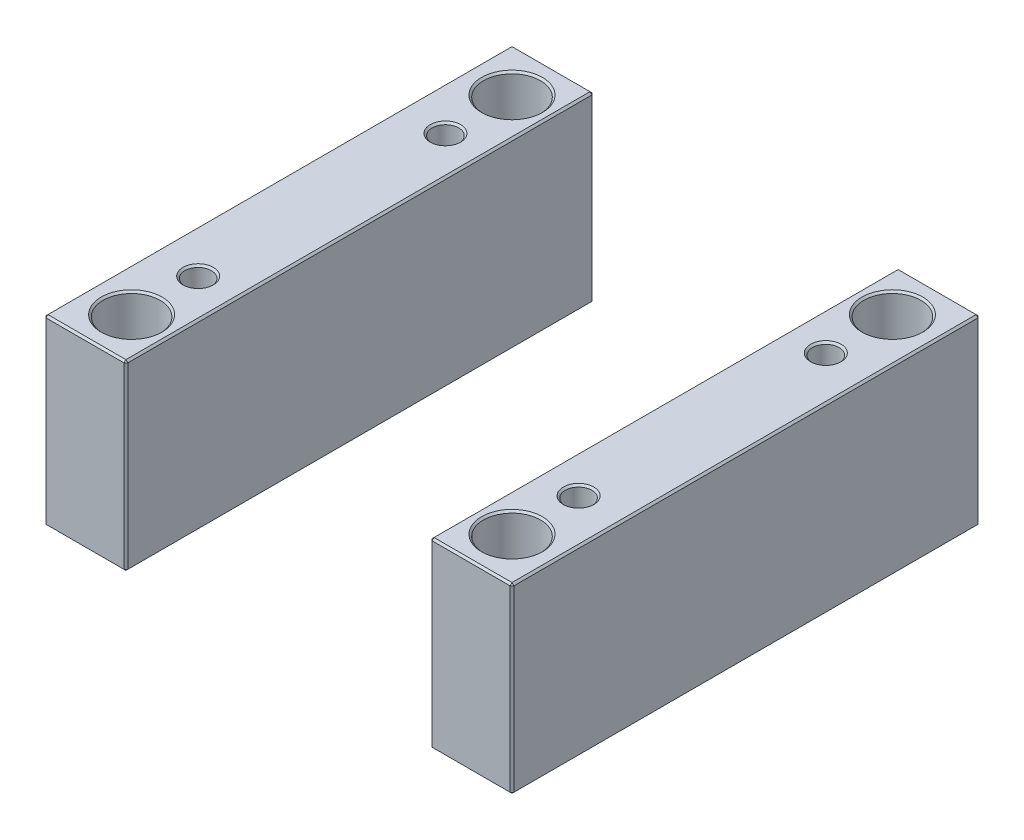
ISO-10303-21;
HEADER;
FILE_DESCRIPTION(('STEP AP214'),'2;1');
FILE_NAME('part.step','',(''),(''),'','','');
FILE_SCHEMA(('AUTOMOTIVE_DESIGN { 1 0 10303 214 1 1 1 1 }'));
ENDSEC;
DATA;
#1=APPLICATION_CONTEXT('core data for automotive mechanical design processes');
#2=APPLICATION_PROTOCOL_DEFINITION('international standard','automotive_design',2000,#1);
#3=PRODUCT_CONTEXT('',#1,'mechanical');
#4=PRODUCT('Part','Part','',(#3));
#5=PRODUCT_RELATED_PRODUCT_CATEGORY('part','',(#4));
#6=PRODUCT_DEFINITION_FORMATION('','',#4);
#7=PRODUCT_DEFINITION_CONTEXT('part definition',#1,'design');
#8=PRODUCT_DEFINITION('design','',#6,#7);
#9=PRODUCT_DEFINITION_SHAPE('','',#8);
#10=(LENGTH_UNIT() NAMED_UNIT(*) SI_UNIT(.MILLI.,.METRE.));
#11=(NAMED_UNIT(*) PLANE_ANGLE_UNIT() SI_UNIT($,.RADIAN.));
#12=(NAMED_UNIT(*) SI_UNIT($,.STERADIAN.) SOLID_ANGLE_UNIT());
#13=UNCERTAINTY_MEASURE_WITH_UNIT(LENGTH_MEASURE(1.E-05),#10,'distance_accuracy_value','');
#14=(GEOMETRIC_REPRESENTATION_CONTEXT(3) GLOBAL_UNCERTAINTY_ASSIGNED_CONTEXT((#13)) GLOBAL_UNIT_ASSIGNED_CONTEXT((#10,
#11,#12)) REPRESENTATION_CONTEXT('',''));
#15=CARTESIAN_POINT('',(0.,0.,0.));
#16=DIRECTION('',(0.,0.,1.));
#17=DIRECTION('',(1.,0.,0.));
#18=AXIS2_PLACEMENT_3D('',#15,#16,#17);
#19=CARTESIAN_POINT('',(-123.,96.,-123.));
#20=DIRECTION('',(0.,0.,1.));
#21=DIRECTION('',(1.,0.,0.));
#22=AXIS2_PLACEMENT_3D('',#19,#20,#21);
#23=PLANE('',#22);
#24=DIRECTION('',(-1.,0.,0.));
#25=VECTOR('',#24,1.);
#26=CARTESIAN_POINT('',(-123.,1.,-123.));
#27=LINE('',#26,#25);
#28=CARTESIAN_POINT('',(-81.,1.,-123.));
#29=VERTEX_POINT('',#28);
#30=CARTESIAN_POINT('',(-122.,1.,-123.));
#31=VERTEX_POINT('',#30);
#32=EDGE_CURVE('P0_E137',#29,#31,#27,.T.);
#33=ORIENTED_EDGE('',*,*,#32,.T.);
#34=DIRECTION('',(0.,1.,0.));
#35=VECTOR('',#34,1.);
#36=CARTESIAN_POINT('',(-122.,96.,-123.));
#37=LINE('',#36,#35);
#38=CARTESIAN_POINT('',(-122.,95.,-123.));
#39=VERTEX_POINT('',#38);
#40=EDGE_CURVE('P0_E265',#31,#39,#37,.T.);
#41=ORIENTED_EDGE('',*,*,#40,.T.);
#42=DIRECTION('',(1.,0.,0.));
#43=VECTOR('',#42,1.);
#44=CARTESIAN_POINT('',(-123.,95.,-123.));
#45=LINE('',#44,#43);
#46=CARTESIAN_POINT('',(-81.,95.,-123.));
#47=VERTEX_POINT('',#46);
#48=EDGE_CURVE('P0_E263',#39,#47,#45,.T.);
#49=ORIENTED_EDGE('',*,*,#48,.T.);
#50=DIRECTION('',(0.,-1.,0.));
#51=VECTOR('',#50,1.);
#52=CARTESIAN_POINT('',(-81.,96.,-123.));
#53=LINE('',#52,#51);
#54=EDGE_CURVE('P0_E260',#47,#29,#53,.T.);
#55=ORIENTED_EDGE('',*,*,#54,.T.);
#56=EDGE_LOOP('',(#33,#41,#49,#55));
#57=FACE_BOUND('',#56,.T.);
#58=ADVANCED_FACE('P0_F16',(#57),#23,.F.);
#59=CARTESIAN_POINT('',(-123.,96.,123.));
#60=DIRECTION('',(1.,0.,0.));
#61=DIRECTION('',(0.,0.,-1.));
#62=AXIS2_PLACEMENT_3D('',#59,#60,#61);
#63=PLANE('',#62);
#64=DIRECTION('',(0.,1.,0.));
#65=VECTOR('',#64,1.);
#66=CARTESIAN_POINT('',(-123.,96.,122.));
#67=LINE('',#66,#65);
#68=CARTESIAN_POINT('',(-123.,1.,122.));
#69=VERTEX_POINT('',#68);
#70=CARTESIAN_POINT('',(-123.,95.,122.));
#71=VERTEX_POINT('',#70);
#72=EDGE_CURVE('P0_E253',#69,#71,#67,.T.);
#73=ORIENTED_EDGE('',*,*,#72,.T.);
#74=DIRECTION('',(0.,0.,-1.));
#75=VECTOR('',#74,1.);
#76=CARTESIAN_POINT('',(-123.,95.,123.));
#77=LINE('',#76,#75);
#78=CARTESIAN_POINT('',(-123.,95.,-122.));
#79=VERTEX_POINT('',#78);
#80=EDGE_CURVE('P0_E258',#71,#79,#77,.T.);
#81=ORIENTED_EDGE('',*,*,#80,.T.);
#82=DIRECTION('',(0.,-1.,0.));
#83=VECTOR('',#82,1.);
#84=CARTESIAN_POINT('',(-123.,96.,-122.));
#85=LINE('',#84,#83);
#86=CARTESIAN_POINT('',(-123.,1.,-122.));
#87=VERTEX_POINT('',#86);
#88=EDGE_CURVE('P0_E255',#79,#87,#85,.T.);
#89=ORIENTED_EDGE('',*,*,#88,.T.);
#90=DIRECTION('',(0.,0.,1.));
#91=VECTOR('',#90,1.);
#92=CARTESIAN_POINT('',(-123.,1.,123.));
#93=LINE('',#92,#91);
#94=EDGE_CURVE('P0_E251',#87,#69,#93,.T.);
#95=ORIENTED_EDGE('',*,*,#94,.T.);
#96=EDGE_LOOP('',(#73,#81,#89,#95));
#97=FACE_BOUND('',#96,.T.);
#98=ADVANCED_FACE('P0_F333',(#97),#63,.F.);
#99=CARTESIAN_POINT('',(-123.,96.,123.));
#100=DIRECTION('',(0.,0.,-1.));
#101=DIRECTION('',(-1.,0.,0.));
#102=AXIS2_PLACEMENT_3D('',#99,#100,#101);
#103=PLANE('',#102);
#104=DIRECTION('',(-1.,0.,0.));
#105=VECTOR('',#104,1.);
#106=CARTESIAN_POINT('',(-123.,95.,123.));
#107=LINE('',#106,#105);
#108=CARTESIAN_POINT('',(-81.,95.,123.));
#109=VERTEX_POINT('',#108);
#110=CARTESIAN_POINT('',(-122.,95.,123.));
#111=VERTEX_POINT('',#110);
#112=EDGE_CURVE('P0_E272',#109,#111,#107,.T.);
#113=ORIENTED_EDGE('',*,*,#112,.T.);
#114=DIRECTION('',(0.,-1.,0.));
#115=VECTOR('',#114,1.);
#116=CARTESIAN_POINT('',(-122.,96.,123.));
#117=LINE('',#116,#115);
#118=CARTESIAN_POINT('',(-122.,1.,123.));
#119=VERTEX_POINT('',#118);
#120=EDGE_CURVE('P0_E274',#111,#119,#117,.T.);
#121=ORIENTED_EDGE('',*,*,#120,.T.);
#122=DIRECTION('',(1.,0.,0.));
#123=VECTOR('',#122,1.);
#124=CARTESIAN_POINT('',(-80.,1.,123.));
#125=LINE('',#124,#123);
#126=CARTESIAN_POINT('',(-81.,1.,123.));
#127=VERTEX_POINT('',#126);
#128=EDGE_CURVE('P0_E270',#119,#127,#125,.T.);
#129=ORIENTED_EDGE('',*,*,#128,.T.);
#130=DIRECTION('',(0.,1.,0.));
#131=VECTOR('',#130,1.);
#132=CARTESIAN_POINT('',(-81.,96.,123.));
#133=LINE('',#132,#131);
#134=EDGE_CURVE('P0_E268',#127,#109,#133,.T.);
#135=ORIENTED_EDGE('',*,*,#134,.T.);
#136=EDGE_LOOP('',(#113,#121,#129,#135));
#137=FACE_BOUND('',#136,.T.);
#138=ADVANCED_FACE('P0_F372',(#137),#103,.F.);
#139=CARTESIAN_POINT('',(-80.,96.,-123.));
#140=DIRECTION('',(-1.,0.,0.));
#141=DIRECTION('',(0.,0.,1.));
#142=AXIS2_PLACEMENT_3D('',#139,#140,#141);
#143=PLANE('',#142);
#144=DIRECTION('',(0.,0.,1.));
#145=VECTOR('',#144,1.);
#146=CARTESIAN_POINT('',(-80.,95.,-123.));
#147=LINE('',#146,#145);
#148=CARTESIAN_POINT('',(-80.,95.,-122.));
#149=VERTEX_POINT('',#148);
#150=CARTESIAN_POINT('',(-80.,95.,122.));
#151=VERTEX_POINT('',#150);
#152=EDGE_CURVE('P0_E31',#149,#151,#147,.T.);
#153=ORIENTED_EDGE('',*,*,#152,.T.);
#154=DIRECTION('',(0.,-1.,0.));
#155=VECTOR('',#154,1.);
#156=CARTESIAN_POINT('',(-80.,96.,122.));
#157=LINE('',#156,#155);
#158=CARTESIAN_POINT('',(-80.,1.,122.));
#159=VERTEX_POINT('',#158);
#160=EDGE_CURVE('P0_E190',#151,#159,#157,.T.);
#161=ORIENTED_EDGE('',*,*,#160,.T.);
#162=DIRECTION('',(0.,0.,-1.));
#163=VECTOR('',#162,1.);
#164=CARTESIAN_POINT('',(-80.,1.,-123.));
#165=LINE('',#164,#163);
#166=CARTESIAN_POINT('',(-80.,1.,-122.));
#167=VERTEX_POINT('',#166);
#168=EDGE_CURVE('P0_E286',#159,#167,#165,.T.);
#169=ORIENTED_EDGE('',*,*,#168,.T.);
#170=DIRECTION('',(0.,1.,0.));
#171=VECTOR('',#170,1.);
#172=CARTESIAN_POINT('',(-80.,96.,-122.));
#173=LINE('',#172,#171);
#174=EDGE_CURVE('P0_E36',#167,#149,#173,.T.);
#175=ORIENTED_EDGE('',*,*,#174,.T.);
#176=EDGE_LOOP('',(#153,#161,#169,#175));
#177=FACE_BOUND('',#176,.T.);
#178=ADVANCED_FACE('P0_F649',(#177),#143,.F.);
#179=CARTESIAN_POINT('',(0.,96.,0.));
#180=DIRECTION('',(0.,-1.,0.));
#181=DIRECTION('',(0.,0.,-1.));
#182=AXIS2_PLACEMENT_3D('',#179,#180,#181);
#183=PLANE('',#182);
#184=CARTESIAN_POINT('',(-100.,96.,-100.));
#185=DIRECTION('',(0.,-1.,0.));
#186=DIRECTION('',(0.,0.,-1.));
#187=AXIS2_PLACEMENT_3D('',#184,#185,#186);
#188=CIRCLE('',#187,16.);
#189=CARTESIAN_POINT('',(-100.,96.,-116.));
#190=VERTEX_POINT('',#189);
#191=EDGE_CURVE('P0_E214',#190,#190,#188,.T.);
#192=ORIENTED_EDGE('',*,*,#191,.T.);
#193=EDGE_LOOP('',(#192));
#194=FACE_BOUND('',#193,.T.);
#195=CARTESIAN_POINT('',(-100.,96.,100.));
#196=DIRECTION('',(0.,-1.,0.));
#197=DIRECTION('',(0.,0.,-1.));
#198=AXIS2_PLACEMENT_3D('',#195,#196,#197);
#199=CIRCLE('',#198,16.);
#200=CARTESIAN_POINT('',(-100.,96.,84.));
#201=VERTEX_POINT('',#200);
#202=EDGE_CURVE('P0_E211',#201,#201,#199,.T.);
#203=ORIENTED_EDGE('',*,*,#202,.T.);
#204=EDGE_LOOP('',(#203));
#205=FACE_BOUND('',#204,.T.);
#206=CARTESIAN_POINT('',(-100.,96.,65.));
#207=DIRECTION('',(0.,-1.,0.));
#208=DIRECTION('',(0.,0.,-1.));
#209=AXIS2_PLACEMENT_3D('',#206,#207,#208);
#210=CIRCLE('',#209,8.);
#211=CARTESIAN_POINT('',(-100.,96.,57.));
#212=VERTEX_POINT('',#211);
#213=EDGE_CURVE('P0_E193',#212,#212,#210,.T.);
#214=ORIENTED_EDGE('',*,*,#213,.T.);
#215=EDGE_LOOP('',(#214));
#216=FACE_BOUND('',#215,.T.);
#217=CARTESIAN_POINT('',(-100.,96.,-65.));
#218=DIRECTION('',(0.,-1.,0.));
#219=DIRECTION('',(0.,0.,-1.));
#220=AXIS2_PLACEMENT_3D('',#217,#218,#219);
#221=CIRCLE('',#220,8.);
#222=CARTESIAN_POINT('',(-100.,96.,-73.));
#223=VERTEX_POINT('',#222);
#224=EDGE_CURVE('P0_E189',#223,#223,#221,.T.);
#225=ORIENTED_EDGE('',*,*,#224,.T.);
#226=EDGE_LOOP('',(#225));
#227=FACE_BOUND('',#226,.T.);
#228=DIRECTION('',(0.,0.,1.));
#229=VECTOR('',#228,1.);
#230=CARTESIAN_POINT('',(-122.,96.,0.));
#231=LINE('',#230,#229);
#232=CARTESIAN_POINT('',(-122.,96.,-122.));
#233=VERTEX_POINT('',#232);
#234=CARTESIAN_POINT('',(-122.,96.,122.));
#235=VERTEX_POINT('',#234);
#236=EDGE_CURVE('P0_E281',#233,#235,#231,.T.);
#237=ORIENTED_EDGE('',*,*,#236,.T.);
#238=DIRECTION('',(1.,0.,0.));
#239=VECTOR('',#238,1.);
#240=CARTESIAN_POINT('',(0.,96.,122.));
#241=LINE('',#240,#239);
#242=CARTESIAN_POINT('',(-81.,96.,122.));
#243=VERTEX_POINT('',#242);
#244=EDGE_CURVE('P0_E283',#235,#243,#241,.T.);
#245=ORIENTED_EDGE('',*,*,#244,.T.);
#246=DIRECTION('',(0.,0.,-1.));
#247=VECTOR('',#246,1.);
#248=CARTESIAN_POINT('',(-81.,96.,0.));
#249=LINE('',#248,#247);
#250=CARTESIAN_POINT('',(-81.,96.,-122.));
#251=VERTEX_POINT('',#250);
#252=EDGE_CURVE('P0_E277',#243,#251,#249,.T.);
#253=ORIENTED_EDGE('',*,*,#252,.T.);
#254=DIRECTION('',(-1.,0.,0.));
#255=VECTOR('',#254,1.);
#256=CARTESIAN_POINT('',(0.,96.,-122.));
#257=LINE('',#256,#255);
#258=EDGE_CURVE('P0_E279',#251,#233,#257,.T.);
#259=ORIENTED_EDGE('',*,*,#258,.T.);
#260=EDGE_LOOP('',(#237,#245,#253,#259));
#261=FACE_BOUND('',#260,.T.);
#262=ADVANCED_FACE('P0_F229',(#194,#205,#216,#227,#261),#183,.F.);
#263=CARTESIAN_POINT('',(0.,0.,0.));
#264=DIRECTION('',(0.,-1.,0.));
#265=DIRECTION('',(0.,0.,-1.));
#266=AXIS2_PLACEMENT_3D('',#263,#264,#265);
#267=PLANE('',#266);
#268=CARTESIAN_POINT('',(-100.,0.,-100.));
#269=DIRECTION('',(0.,-1.,0.));
#270=DIRECTION('',(0.,0.,-1.));
#271=AXIS2_PLACEMENT_3D('',#268,#269,#270);
#272=CIRCLE('',#271,16.);
#273=CARTESIAN_POINT('',(-100.,0.,-116.));
#274=VERTEX_POINT('',#273);
#275=EDGE_CURVE('P0_E202',#274,#274,#272,.F.);
#276=ORIENTED_EDGE('',*,*,#275,.T.);
#277=EDGE_LOOP('',(#276));
#278=FACE_BOUND('',#277,.T.);
#279=CARTESIAN_POINT('',(-100.,0.,100.));
#280=DIRECTION('',(0.,-1.,0.));
#281=DIRECTION('',(0.,0.,-1.));
#282=AXIS2_PLACEMENT_3D('',#279,#280,#281);
#283=CIRCLE('',#282,16.);
#284=CARTESIAN_POINT('',(-100.,0.,84.));
#285=VERTEX_POINT('',#284);
#286=EDGE_CURVE('P0_E199',#285,#285,#283,.F.);
#287=ORIENTED_EDGE('',*,*,#286,.T.);
#288=EDGE_LOOP('',(#287));
#289=FACE_BOUND('',#288,.T.);
#290=CARTESIAN_POINT('',(-100.,0.,-65.));
#291=DIRECTION('',(0.,-1.,0.));
#292=DIRECTION('',(0.,0.,-1.));
#293=AXIS2_PLACEMENT_3D('',#290,#291,#292);
#294=CIRCLE('',#293,8.);
#295=CARTESIAN_POINT('',(-100.,0.,-73.));
#296=VERTEX_POINT('',#295);
#297=EDGE_CURVE('P0_E235',#296,#296,#294,.F.);
#298=ORIENTED_EDGE('',*,*,#297,.T.);
#299=EDGE_LOOP('',(#298));
#300=FACE_BOUND('',#299,.T.);
#301=CARTESIAN_POINT('',(-100.,0.,65.));
#302=DIRECTION('',(0.,-1.,0.));
#303=DIRECTION('',(0.,0.,-1.));
#304=AXIS2_PLACEMENT_3D('',#301,#302,#303);
#305=CIRCLE('',#304,8.);
#306=CARTESIAN_POINT('',(-100.,0.,57.));
#307=VERTEX_POINT('',#306);
#308=EDGE_CURVE('P0_E238',#307,#307,#305,.F.);
#309=ORIENTED_EDGE('',*,*,#308,.T.);
#310=EDGE_LOOP('',(#309));
#311=FACE_BOUND('',#310,.T.);
#312=DIRECTION('',(-1.,0.,0.));
#313=VECTOR('',#312,1.);
#314=CARTESIAN_POINT('',(-123.,0.,122.));
#315=LINE('',#314,#313);
#316=CARTESIAN_POINT('',(-81.,0.,122.));
#317=VERTEX_POINT('',#316);
#318=CARTESIAN_POINT('',(-122.,0.,122.));
#319=VERTEX_POINT('',#318);
#320=EDGE_CURVE('P0_E114',#317,#319,#315,.T.);
#321=ORIENTED_EDGE('',*,*,#320,.T.);
#322=DIRECTION('',(0.,0.,-1.));
#323=VECTOR('',#322,1.);
#324=CARTESIAN_POINT('',(-122.,0.,-123.));
#325=LINE('',#324,#323);
#326=CARTESIAN_POINT('',(-122.,0.,-122.));
#327=VERTEX_POINT('',#326);
#328=EDGE_CURVE('P0_E110',#319,#327,#325,.T.);
#329=ORIENTED_EDGE('',*,*,#328,.T.);
#330=DIRECTION('',(1.,0.,0.));
#331=VECTOR('',#330,1.);
#332=CARTESIAN_POINT('',(-80.,0.,-122.));
#333=LINE('',#332,#331);
#334=CARTESIAN_POINT('',(-81.,0.,-122.));
#335=VERTEX_POINT('',#334);
#336=EDGE_CURVE('P0_E104',#327,#335,#333,.T.);
#337=ORIENTED_EDGE('',*,*,#336,.T.);
#338=DIRECTION('',(0.,0.,1.));
#339=VECTOR('',#338,1.);
#340=CARTESIAN_POINT('',(-81.,0.,123.));
#341=LINE('',#340,#339);
#342=EDGE_CURVE('P0_E107',#335,#317,#341,.T.);
#343=ORIENTED_EDGE('',*,*,#342,.T.);
#344=EDGE_LOOP('',(#321,#329,#337,#343));
#345=FACE_BOUND('',#344,.T.);
#346=ADVANCED_FACE('P0_F106',(#278,#289,#300,#311,#345),#267,.T.);
#347=CARTESIAN_POINT('',(-100.,0.,-65.));
#348=DIRECTION('',(0.,1.,0.));
#349=DIRECTION('',(0.,0.,1.));
#350=AXIS2_PLACEMENT_3D('',#347,#348,#349);
#351=CYLINDRICAL_SURFACE('',#350,7.);
#352=CARTESIAN_POINT('',(-100.,95.,-65.));
#353=DIRECTION('',(0.,-1.,0.));
#354=DIRECTION('',(0.,0.,-1.));
#355=AXIS2_PLACEMENT_3D('',#352,#353,#354);
#356=CIRCLE('',#355,7.);
#357=CARTESIAN_POINT('',(-100.,95.,-72.));
#358=VERTEX_POINT('',#357);
#359=EDGE_CURVE('P0_E196',#358,#358,#356,.F.);
#360=ORIENTED_EDGE('',*,*,#359,.T.);
#361=EDGE_LOOP('',(#360));
#362=FACE_BOUND('',#361,.T.);
#363=CARTESIAN_POINT('',(-100.,0.999999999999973,-65.));
#364=DIRECTION('',(0.,-1.,0.));
#365=DIRECTION('',(0.,0.,-1.));
#366=AXIS2_PLACEMENT_3D('',#363,#364,#365);
#367=CIRCLE('',#366,7.);
#368=CARTESIAN_POINT('',(-100.,0.999999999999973,-72.));
#369=VERTEX_POINT('',#368);
#370=EDGE_CURVE('P0_E241',#369,#369,#367,.T.);
#371=ORIENTED_EDGE('',*,*,#370,.T.);
#372=EDGE_LOOP('',(#371));
#373=FACE_BOUND('',#372,.T.);
#374=ADVANCED_FACE('P0_F228',(#362,#373),#351,.F.);
#375=CARTESIAN_POINT('',(-100.,0.,65.));
#376=DIRECTION('',(0.,1.,0.));
#377=DIRECTION('',(0.,0.,1.));
#378=AXIS2_PLACEMENT_3D('',#375,#376,#377);
#379=CYLINDRICAL_SURFACE('',#378,7.);
#380=CARTESIAN_POINT('',(-100.,95.,65.));
#381=DIRECTION('',(0.,-1.,0.));
#382=DIRECTION('',(0.,0.,-1.));
#383=AXIS2_PLACEMENT_3D('',#380,#381,#382);
#384=CIRCLE('',#383,7.);
#385=CARTESIAN_POINT('',(-100.,95.,58.));
#386=VERTEX_POINT('',#385);
#387=EDGE_CURVE('P0_E186',#386,#386,#384,.F.);
#388=ORIENTED_EDGE('',*,*,#387,.T.);
#389=EDGE_LOOP('',(#388));
#390=FACE_BOUND('',#389,.T.);
#391=CARTESIAN_POINT('',(-100.,1.00000000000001,65.));
#392=DIRECTION('',(0.,-1.,0.));
#393=DIRECTION('',(0.,0.,-1.));
#394=AXIS2_PLACEMENT_3D('',#391,#392,#393);
#395=CIRCLE('',#394,7.);
#396=CARTESIAN_POINT('',(-100.,1.00000000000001,58.));
#397=VERTEX_POINT('',#396);
#398=EDGE_CURVE('P0_E248',#397,#397,#395,.T.);
#399=ORIENTED_EDGE('',*,*,#398,.T.);
#400=EDGE_LOOP('',(#399));
#401=FACE_BOUND('',#400,.T.);
#402=ADVANCED_FACE('P0_F380',(#390,#401),#379,.F.);
#403=CARTESIAN_POINT('',(-100.,0.,-65.));
#404=DIRECTION('',(0.,-1.,0.));
#405=DIRECTION('',(0.,0.,-1.));
#406=AXIS2_PLACEMENT_3D('',#403,#404,#405);
#407=CONICAL_SURFACE('',#406,8.,0.78539816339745);
#408=ORIENTED_EDGE('',*,*,#370,.F.);
#409=EDGE_LOOP('',(#408));
#410=FACE_BOUND('',#409,.T.);
#411=ORIENTED_EDGE('',*,*,#297,.F.);
#412=EDGE_LOOP('',(#411));
#413=FACE_BOUND('',#412,.T.);
#414=ADVANCED_FACE('P0_F376',(#410,#413),#407,.F.);
#415=CARTESIAN_POINT('',(-100.,0.,65.));
#416=DIRECTION('',(0.,-1.,0.));
#417=DIRECTION('',(0.,0.,-1.));
#418=AXIS2_PLACEMENT_3D('',#415,#416,#417);
#419=CONICAL_SURFACE('',#418,8.,0.785398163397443);
#420=ORIENTED_EDGE('',*,*,#398,.F.);
#421=EDGE_LOOP('',(#420));
#422=FACE_BOUND('',#421,.T.);
#423=ORIENTED_EDGE('',*,*,#308,.F.);
#424=EDGE_LOOP('',(#423));
#425=FACE_BOUND('',#424,.T.);
#426=ADVANCED_FACE('P0_F379',(#422,#425),#419,.F.);
#427=CARTESIAN_POINT('',(-80.,96.,122.));
#428=DIRECTION('',(-0.707106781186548,0.,-0.707106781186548));
#429=DIRECTION('',(0.,-1.,0.));
#430=AXIS2_PLACEMENT_3D('',#427,#428,#429);
#431=PLANE('',#430);
#432=DIRECTION('',(-0.707106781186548,0.,0.707106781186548));
#433=VECTOR('',#432,1.);
#434=CARTESIAN_POINT('',(-80.5,95.,122.5));
#435=LINE('',#434,#433);
#436=EDGE_CURVE('P0_E125',#109,#151,#435,.F.);
#437=ORIENTED_EDGE('',*,*,#436,.F.);
#438=ORIENTED_EDGE('',*,*,#134,.F.);
#439=DIRECTION('',(0.707106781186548,0.,-0.707106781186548));
#440=VECTOR('',#439,1.);
#441=CARTESIAN_POINT('',(-81.,1.,123.));
#442=LINE('',#441,#440);
#443=EDGE_CURVE('P0_E181',#159,#127,#442,.F.);
#444=ORIENTED_EDGE('',*,*,#443,.F.);
#445=ORIENTED_EDGE('',*,*,#160,.F.);
#446=EDGE_LOOP('',(#437,#438,#444,#445));
#447=FACE_BOUND('',#446,.T.);
#448=ADVANCED_FACE('P0_F384',(#447),#431,.F.);
#449=CARTESIAN_POINT('',(-81.,96.,122.));
#450=DIRECTION('',(0.577350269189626,0.577350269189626,0.577350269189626));
#451=DIRECTION('',(0.707106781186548,0.,-0.707106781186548));
#452=AXIS2_PLACEMENT_3D('',#449,#450,#451);
#453=PLANE('',#452);
#454=DIRECTION('',(0.,0.707106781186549,-0.707106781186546));
#455=VECTOR('',#454,1.);
#456=CARTESIAN_POINT('',(-81.,96.,122.));
#457=LINE('',#456,#455);
#458=EDGE_CURVE('P0_E175',#109,#243,#457,.T.);
#459=ORIENTED_EDGE('',*,*,#458,.F.);
#460=ORIENTED_EDGE('',*,*,#436,.T.);
#461=DIRECTION('',(0.707106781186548,-0.707106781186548,0.));
#462=VECTOR('',#461,1.);
#463=CARTESIAN_POINT('',(-81.,96.,122.));
#464=LINE('',#463,#462);
#465=EDGE_CURVE('P0_E178',#243,#151,#464,.T.);
#466=ORIENTED_EDGE('',*,*,#465,.F.);
#467=EDGE_LOOP('',(#459,#460,#466));
#468=FACE_BOUND('',#467,.T.);
#469=ADVANCED_FACE('P0_F588',(#468),#453,.T.);
#470=CARTESIAN_POINT('',(-81.,1.,123.));
#471=DIRECTION('',(0.577350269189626,-0.577350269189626,0.577350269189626));
#472=DIRECTION('',(0.707106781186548,0.,-0.707106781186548));
#473=AXIS2_PLACEMENT_3D('',#470,#471,#472);
#474=PLANE('',#473);
#475=DIRECTION('',(0.707106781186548,0.707106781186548,0.));
#476=VECTOR('',#475,1.);
#477=CARTESIAN_POINT('',(-80.5,0.5,122.));
#478=LINE('',#477,#476);
#479=EDGE_CURVE('P0_E123',#159,#317,#478,.F.);
#480=ORIENTED_EDGE('',*,*,#479,.F.);
#481=ORIENTED_EDGE('',*,*,#443,.T.);
#482=DIRECTION('',(0.,-0.707106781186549,-0.707106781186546));
#483=VECTOR('',#482,1.);
#484=CARTESIAN_POINT('',(-81.,1.,123.));
#485=LINE('',#484,#483);
#486=EDGE_CURVE('P0_E172',#317,#127,#485,.F.);
#487=ORIENTED_EDGE('',*,*,#486,.F.);
#488=EDGE_LOOP('',(#480,#481,#487));
#489=FACE_BOUND('',#488,.T.);
#490=ADVANCED_FACE('P0_F597',(#489),#474,.T.);
#491=CARTESIAN_POINT('',(-81.,96.,0.));
#492=DIRECTION('',(-0.707106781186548,-0.707106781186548,0.));
#493=DIRECTION('',(0.,0.,-1.));
#494=AXIS2_PLACEMENT_3D('',#491,#492,#493);
#495=PLANE('',#494);
#496=ORIENTED_EDGE('',*,*,#465,.T.);
#497=ORIENTED_EDGE('',*,*,#152,.F.);
#498=DIRECTION('',(-0.707106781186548,0.707106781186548,0.));
#499=VECTOR('',#498,1.);
#500=CARTESIAN_POINT('',(-80.5,95.5,-122.));
#501=LINE('',#500,#499);
#502=EDGE_CURVE('P0_E165',#251,#149,#501,.F.);
#503=ORIENTED_EDGE('',*,*,#502,.F.);
#504=ORIENTED_EDGE('',*,*,#252,.F.);
#505=EDGE_LOOP('',(#496,#497,#503,#504));
#506=FACE_BOUND('',#505,.T.);
#507=ADVANCED_FACE('P0_F349',(#506),#495,.F.);
#508=CARTESIAN_POINT('',(0.,96.,122.));
#509=DIRECTION('',(0.,-0.707106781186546,-0.707106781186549));
#510=DIRECTION('',(1.,0.,0.));
#511=AXIS2_PLACEMENT_3D('',#508,#509,#510);
#512=PLANE('',#511);
#513=ORIENTED_EDGE('',*,*,#458,.T.);
#514=ORIENTED_EDGE('',*,*,#244,.F.);
#515=DIRECTION('',(0.,-0.707106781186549,0.707106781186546));
#516=VECTOR('',#515,1.);
#517=CARTESIAN_POINT('',(-122.,95.5,122.5));
#518=LINE('',#517,#516);
#519=EDGE_CURVE('P0_E162',#111,#235,#518,.F.);
#520=ORIENTED_EDGE('',*,*,#519,.F.);
#521=ORIENTED_EDGE('',*,*,#112,.F.);
#522=EDGE_LOOP('',(#513,#514,#520,#521));
#523=FACE_BOUND('',#522,.T.);
#524=ADVANCED_FACE('P0_F344',(#523),#512,.F.);
#525=CARTESIAN_POINT('',(-122.,96.,123.));
#526=DIRECTION('',(0.707106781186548,0.,-0.707106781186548));
#527=DIRECTION('',(0.,-1.,0.));
#528=AXIS2_PLACEMENT_3D('',#525,#526,#527);
#529=PLANE('',#528);
#530=DIRECTION('',(0.707106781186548,0.,0.707106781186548));
#531=VECTOR('',#530,1.);
#532=CARTESIAN_POINT('',(-122.,1.,123.));
#533=LINE('',#532,#531);
#534=EDGE_CURVE('P0_E156',#119,#69,#533,.F.);
#535=ORIENTED_EDGE('',*,*,#534,.F.);
#536=ORIENTED_EDGE('',*,*,#120,.F.);
#537=DIRECTION('',(-0.707106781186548,0.,-0.707106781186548));
#538=VECTOR('',#537,1.);
#539=CARTESIAN_POINT('',(-123.,95.,122.));
#540=LINE('',#539,#538);
#541=EDGE_CURVE('P0_E159',#71,#111,#540,.F.);
#542=ORIENTED_EDGE('',*,*,#541,.F.);
#543=ORIENTED_EDGE('',*,*,#72,.F.);
#544=EDGE_LOOP('',(#535,#536,#542,#543));
#545=FACE_BOUND('',#544,.T.);
#546=ADVANCED_FACE('P0_F338',(#545),#529,.F.);
#547=CARTESIAN_POINT('',(-123.,1.,123.));
#548=DIRECTION('',(0.,-0.707106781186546,0.707106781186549));
#549=DIRECTION('',(-1.,0.,0.));
#550=AXIS2_PLACEMENT_3D('',#547,#548,#549);
#551=PLANE('',#550);
#552=ORIENTED_EDGE('',*,*,#486,.T.);
#553=ORIENTED_EDGE('',*,*,#128,.F.);
#554=DIRECTION('',(0.,0.707106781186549,0.707106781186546));
#555=VECTOR('',#554,1.);
#556=CARTESIAN_POINT('',(-122.,1.,123.));
#557=LINE('',#556,#555);
#558=EDGE_CURVE('P0_E134',#319,#119,#557,.T.);
#559=ORIENTED_EDGE('',*,*,#558,.F.);
#560=ORIENTED_EDGE('',*,*,#320,.F.);
#561=EDGE_LOOP('',(#552,#553,#559,#560));
#562=FACE_BOUND('',#561,.T.);
#563=ADVANCED_FACE('P0_F364',(#562),#551,.T.);
#564=CARTESIAN_POINT('',(-80.,1.,-123.));
#565=DIRECTION('',(0.707106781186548,-0.707106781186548,0.));
#566=DIRECTION('',(0.,0.,1.));
#567=AXIS2_PLACEMENT_3D('',#564,#565,#566);
#568=PLANE('',#567);
#569=ORIENTED_EDGE('',*,*,#479,.T.);
#570=ORIENTED_EDGE('',*,*,#342,.F.);
#571=DIRECTION('',(-0.707106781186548,-0.707106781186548,0.));
#572=VECTOR('',#571,1.);
#573=CARTESIAN_POINT('',(-81.,0.,-122.));
#574=LINE('',#573,#572);
#575=EDGE_CURVE('P0_E120',#167,#335,#574,.T.);
#576=ORIENTED_EDGE('',*,*,#575,.F.);
#577=ORIENTED_EDGE('',*,*,#168,.F.);
#578=EDGE_LOOP('',(#569,#570,#576,#577));
#579=FACE_BOUND('',#578,.T.);
#580=ADVANCED_FACE('P0_F119',(#579),#568,.T.);
#581=CARTESIAN_POINT('',(-81.,96.,-123.));
#582=DIRECTION('',(-0.707106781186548,0.,0.707106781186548));
#583=DIRECTION('',(0.,-1.,0.));
#584=AXIS2_PLACEMENT_3D('',#581,#582,#583);
#585=PLANE('',#584);
#586=DIRECTION('',(0.707106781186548,0.,0.707106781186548));
#587=VECTOR('',#586,1.);
#588=CARTESIAN_POINT('',(-81.,95.,-123.));
#589=LINE('',#588,#587);
#590=EDGE_CURVE('P0_E168',#149,#47,#589,.F.);
#591=ORIENTED_EDGE('',*,*,#590,.F.);
#592=ORIENTED_EDGE('',*,*,#174,.F.);
#593=DIRECTION('',(-0.707106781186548,0.,-0.707106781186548));
#594=VECTOR('',#593,1.);
#595=CARTESIAN_POINT('',(-80.5,1.,-122.5));
#596=LINE('',#595,#594);
#597=EDGE_CURVE('P0_E133',#29,#167,#596,.F.);
#598=ORIENTED_EDGE('',*,*,#597,.F.);
#599=ORIENTED_EDGE('',*,*,#54,.F.);
#600=EDGE_LOOP('',(#591,#592,#598,#599));
#601=FACE_BOUND('',#600,.T.);
#602=ADVANCED_FACE('P0_F354',(#601),#585,.F.);
#603=CARTESIAN_POINT('',(-81.,95.,-123.));
#604=DIRECTION('',(0.577350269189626,0.577350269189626,-0.577350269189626));
#605=DIRECTION('',(-0.707106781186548,0.,-0.707106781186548));
#606=AXIS2_PLACEMENT_3D('',#603,#604,#605);
#607=PLANE('',#606);
#608=ORIENTED_EDGE('',*,*,#502,.T.);
#609=ORIENTED_EDGE('',*,*,#590,.T.);
#610=DIRECTION('',(0.,-0.707106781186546,-0.707106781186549));
#611=VECTOR('',#610,1.);
#612=CARTESIAN_POINT('',(-81.,95.,-123.));
#613=LINE('',#612,#611);
#614=EDGE_CURVE('P0_E151',#251,#47,#613,.T.);
#615=ORIENTED_EDGE('',*,*,#614,.F.);
#616=EDGE_LOOP('',(#608,#609,#615));
#617=FACE_BOUND('',#616,.T.);
#618=ADVANCED_FACE('P0_F352',(#617),#607,.T.);
#619=CARTESIAN_POINT('',(-123.,95.,122.));
#620=DIRECTION('',(-0.577350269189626,0.577350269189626,0.577350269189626));
#621=DIRECTION('',(0.707106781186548,0.,0.707106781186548));
#622=AXIS2_PLACEMENT_3D('',#619,#620,#621);
#623=PLANE('',#622);
#624=ORIENTED_EDGE('',*,*,#541,.T.);
#625=ORIENTED_EDGE('',*,*,#519,.T.);
#626=DIRECTION('',(0.707106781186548,0.707106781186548,0.));
#627=VECTOR('',#626,1.);
#628=CARTESIAN_POINT('',(-123.,95.,122.));
#629=LINE('',#628,#627);
#630=EDGE_CURVE('P0_E142',#71,#235,#629,.T.);
#631=ORIENTED_EDGE('',*,*,#630,.F.);
#632=EDGE_LOOP('',(#624,#625,#631));
#633=FACE_BOUND('',#632,.T.);
#634=ADVANCED_FACE('P0_F341',(#633),#623,.T.);
#635=CARTESIAN_POINT('',(-122.,1.,123.));
#636=DIRECTION('',(-0.577350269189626,-0.577350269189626,0.577350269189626));
#637=DIRECTION('',(0.707106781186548,0.,0.707106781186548));
#638=AXIS2_PLACEMENT_3D('',#635,#636,#637);
#639=PLANE('',#638);
#640=ORIENTED_EDGE('',*,*,#558,.T.);
#641=ORIENTED_EDGE('',*,*,#534,.T.);
#642=DIRECTION('',(0.707106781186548,-0.707106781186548,0.));
#643=VECTOR('',#642,1.);
#644=CARTESIAN_POINT('',(-122.5,0.5,122.));
#645=LINE('',#644,#643);
#646=EDGE_CURVE('P0_E138',#319,#69,#645,.F.);
#647=ORIENTED_EDGE('',*,*,#646,.F.);
#648=EDGE_LOOP('',(#640,#641,#647));
#649=FACE_BOUND('',#648,.T.);
#650=ADVANCED_FACE('P0_F403',(#649),#639,.T.);
#651=CARTESIAN_POINT('',(-81.,0.,-122.));
#652=DIRECTION('',(0.577350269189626,-0.577350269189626,-0.577350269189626));
#653=DIRECTION('',(-0.707106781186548,0.,-0.707106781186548));
#654=AXIS2_PLACEMENT_3D('',#651,#652,#653);
#655=PLANE('',#654);
#656=ORIENTED_EDGE('',*,*,#597,.T.);
#657=ORIENTED_EDGE('',*,*,#575,.T.);
#658=DIRECTION('',(0.,0.707106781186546,-0.707106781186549));
#659=VECTOR('',#658,1.);
#660=CARTESIAN_POINT('',(-81.,0.,-122.));
#661=LINE('',#660,#659);
#662=EDGE_CURVE('P0_E130',#29,#335,#661,.F.);
#663=ORIENTED_EDGE('',*,*,#662,.F.);
#664=EDGE_LOOP('',(#656,#657,#663));
#665=FACE_BOUND('',#664,.T.);
#666=ADVANCED_FACE('P0_F129',(#665),#655,.T.);
#667=CARTESIAN_POINT('',(0.,96.,-122.));
#668=DIRECTION('',(0.,-0.707106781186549,0.707106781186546));
#669=DIRECTION('',(-1.,0.,0.));
#670=AXIS2_PLACEMENT_3D('',#667,#668,#669);
#671=PLANE('',#670);
#672=ORIENTED_EDGE('',*,*,#614,.T.);
#673=ORIENTED_EDGE('',*,*,#48,.F.);
#674=DIRECTION('',(0.,0.707106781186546,0.707106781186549));
#675=VECTOR('',#674,1.);
#676=CARTESIAN_POINT('',(-122.,95.,-123.));
#677=LINE('',#676,#675);
#678=EDGE_CURVE('P0_E139',#233,#39,#677,.F.);
#679=ORIENTED_EDGE('',*,*,#678,.F.);
#680=ORIENTED_EDGE('',*,*,#258,.F.);
#681=EDGE_LOOP('',(#672,#673,#679,#680));
#682=FACE_BOUND('',#681,.T.);
#683=ADVANCED_FACE('P0_F316',(#682),#671,.F.);
#684=CARTESIAN_POINT('',(-122.,96.,0.));
#685=DIRECTION('',(0.707106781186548,-0.707106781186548,0.));
#686=DIRECTION('',(0.,0.,1.));
#687=AXIS2_PLACEMENT_3D('',#684,#685,#686);
#688=PLANE('',#687);
#689=ORIENTED_EDGE('',*,*,#630,.T.);
#690=ORIENTED_EDGE('',*,*,#236,.F.);
#691=DIRECTION('',(-0.707106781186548,-0.707106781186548,0.));
#692=VECTOR('',#691,1.);
#693=CARTESIAN_POINT('',(-122.5,95.5,-122.));
#694=LINE('',#693,#692);
#695=EDGE_CURVE('P0_E145',#79,#233,#694,.F.);
#696=ORIENTED_EDGE('',*,*,#695,.F.);
#697=ORIENTED_EDGE('',*,*,#80,.F.);
#698=EDGE_LOOP('',(#689,#690,#696,#697));
#699=FACE_BOUND('',#698,.T.);
#700=ADVANCED_FACE('P0_F310',(#699),#688,.F.);
#701=CARTESIAN_POINT('',(-123.,1.,123.));
#702=DIRECTION('',(-0.707106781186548,-0.707106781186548,0.));
#703=DIRECTION('',(0.,0.,-1.));
#704=AXIS2_PLACEMENT_3D('',#701,#702,#703);
#705=PLANE('',#704);
#706=ORIENTED_EDGE('',*,*,#646,.T.);
#707=ORIENTED_EDGE('',*,*,#94,.F.);
#708=DIRECTION('',(-0.707106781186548,0.707106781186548,0.));
#709=VECTOR('',#708,1.);
#710=CARTESIAN_POINT('',(-123.,1.,-122.));
#711=LINE('',#710,#709);
#712=EDGE_CURVE('P0_E297',#327,#87,#711,.T.);
#713=ORIENTED_EDGE('',*,*,#712,.F.);
#714=ORIENTED_EDGE('',*,*,#328,.F.);
#715=EDGE_LOOP('',(#706,#707,#713,#714));
#716=FACE_BOUND('',#715,.T.);
#717=ADVANCED_FACE('P0_F329',(#716),#705,.T.);
#718=CARTESIAN_POINT('',(-123.,1.,-123.));
#719=DIRECTION('',(0.,-0.707106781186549,-0.707106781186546));
#720=DIRECTION('',(1.,0.,0.));
#721=AXIS2_PLACEMENT_3D('',#718,#719,#720);
#722=PLANE('',#721);
#723=ORIENTED_EDGE('',*,*,#662,.T.);
#724=ORIENTED_EDGE('',*,*,#336,.F.);
#725=DIRECTION('',(0.,-0.707106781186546,0.707106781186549));
#726=VECTOR('',#725,1.);
#727=CARTESIAN_POINT('',(-122.,0.5,-122.5));
#728=LINE('',#727,#726);
#729=EDGE_CURVE('P0_E295',#31,#327,#728,.T.);
#730=ORIENTED_EDGE('',*,*,#729,.F.);
#731=ORIENTED_EDGE('',*,*,#32,.F.);
#732=EDGE_LOOP('',(#723,#724,#730,#731));
#733=FACE_BOUND('',#732,.T.);
#734=ADVANCED_FACE('P0_F136',(#733),#722,.T.);
#735=CARTESIAN_POINT('',(-122.,95.,-123.));
#736=DIRECTION('',(-0.577350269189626,0.577350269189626,-0.577350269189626));
#737=DIRECTION('',(-0.707106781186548,0.,0.707106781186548));
#738=AXIS2_PLACEMENT_3D('',#735,#736,#737);
#739=PLANE('',#738);
#740=ORIENTED_EDGE('',*,*,#695,.T.);
#741=ORIENTED_EDGE('',*,*,#678,.T.);
#742=DIRECTION('',(0.707106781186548,0.,-0.707106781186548));
#743=VECTOR('',#742,1.);
#744=CARTESIAN_POINT('',(-122.,95.,-123.));
#745=LINE('',#744,#743);
#746=EDGE_CURVE('P0_E293',#79,#39,#745,.T.);
#747=ORIENTED_EDGE('',*,*,#746,.F.);
#748=EDGE_LOOP('',(#740,#741,#747));
#749=FACE_BOUND('',#748,.T.);
#750=ADVANCED_FACE('P0_F303',(#749),#739,.T.);
#751=CARTESIAN_POINT('',(-123.,1.,-122.));
#752=DIRECTION('',(-0.577350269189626,-0.577350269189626,-0.577350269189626));
#753=DIRECTION('',(-0.707106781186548,0.,0.707106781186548));
#754=AXIS2_PLACEMENT_3D('',#751,#752,#753);
#755=PLANE('',#754);
#756=ORIENTED_EDGE('',*,*,#729,.T.);
#757=ORIENTED_EDGE('',*,*,#712,.T.);
#758=DIRECTION('',(-0.707106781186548,0.,0.707106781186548));
#759=VECTOR('',#758,1.);
#760=CARTESIAN_POINT('',(-123.,1.,-122.));
#761=LINE('',#760,#759);
#762=EDGE_CURVE('P0_E291',#31,#87,#761,.T.);
#763=ORIENTED_EDGE('',*,*,#762,.F.);
#764=EDGE_LOOP('',(#756,#757,#763));
#765=FACE_BOUND('',#764,.T.);
#766=ADVANCED_FACE('P0_F325',(#765),#755,.T.);
#767=CARTESIAN_POINT('',(-123.,96.,-122.));
#768=DIRECTION('',(0.707106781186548,0.,0.707106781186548));
#769=DIRECTION('',(0.,-1.,0.));
#770=AXIS2_PLACEMENT_3D('',#767,#768,#769);
#771=PLANE('',#770);
#772=ORIENTED_EDGE('',*,*,#746,.T.);
#773=ORIENTED_EDGE('',*,*,#40,.F.);
#774=ORIENTED_EDGE('',*,*,#762,.T.);
#775=ORIENTED_EDGE('',*,*,#88,.F.);
#776=EDGE_LOOP('',(#772,#773,#774,#775));
#777=FACE_BOUND('',#776,.T.);
#778=ADVANCED_FACE('P0_F323',(#777),#771,.F.);
#779=CARTESIAN_POINT('',(-100.,95.,65.));
#780=DIRECTION('',(0.,1.,0.));
#781=DIRECTION('',(0.,0.,1.));
#782=AXIS2_PLACEMENT_3D('',#779,#780,#781);
#783=CONICAL_SURFACE('',#782,7.,0.785398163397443);
#784=ORIENTED_EDGE('',*,*,#213,.F.);
#785=EDGE_LOOP('',(#784));
#786=FACE_BOUND('',#785,.T.);
#787=ORIENTED_EDGE('',*,*,#387,.F.);
#788=EDGE_LOOP('',(#787));
#789=FACE_BOUND('',#788,.T.);
#790=ADVANCED_FACE('P0_F388',(#786,#789),#783,.F.);
#791=CARTESIAN_POINT('',(-100.,95.,-65.));
#792=DIRECTION('',(0.,1.,0.));
#793=DIRECTION('',(0.,0.,1.));
#794=AXIS2_PLACEMENT_3D('',#791,#792,#793);
#795=CONICAL_SURFACE('',#794,7.,0.785398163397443);
#796=ORIENTED_EDGE('',*,*,#224,.F.);
#797=EDGE_LOOP('',(#796));
#798=FACE_BOUND('',#797,.T.);
#799=ORIENTED_EDGE('',*,*,#359,.F.);
#800=EDGE_LOOP('',(#799));
#801=FACE_BOUND('',#800,.T.);
#802=ADVANCED_FACE('P0_F470',(#798,#801),#795,.F.);
#803=CARTESIAN_POINT('',(-100.,0.,100.));
#804=DIRECTION('',(0.,1.,0.));
#805=DIRECTION('',(0.,0.,1.));
#806=AXIS2_PLACEMENT_3D('',#803,#804,#805);
#807=CYLINDRICAL_SURFACE('',#806,15.);
#808=CARTESIAN_POINT('',(-100.,95.,100.));
#809=DIRECTION('',(0.,-1.,0.));
#810=DIRECTION('',(0.,0.,-1.));
#811=AXIS2_PLACEMENT_3D('',#808,#809,#810);
#812=CIRCLE('',#811,15.);
#813=CARTESIAN_POINT('',(-100.,95.,85.));
#814=VERTEX_POINT('',#813);
#815=EDGE_CURVE('P0_E10',#814,#814,#812,.F.);
#816=ORIENTED_EDGE('',*,*,#815,.T.);
#817=EDGE_LOOP('',(#816));
#818=FACE_BOUND('',#817,.T.);
#819=CARTESIAN_POINT('',(-100.,1.,100.));
#820=DIRECTION('',(0.,-1.,0.));
#821=DIRECTION('',(0.,0.,-1.));
#822=AXIS2_PLACEMENT_3D('',#819,#820,#821);
#823=CIRCLE('',#822,15.);
#824=CARTESIAN_POINT('',(-100.,1.,85.));
#825=VERTEX_POINT('',#824);
#826=EDGE_CURVE('P0_E24',#825,#825,#823,.T.);
#827=ORIENTED_EDGE('',*,*,#826,.T.);
#828=EDGE_LOOP('',(#827));
#829=FACE_BOUND('',#828,.T.);
#830=ADVANCED_FACE('P0_F219',(#818,#829),#807,.F.);
#831=CARTESIAN_POINT('',(-100.,0.,-100.));
#832=DIRECTION('',(0.,1.,0.));
#833=DIRECTION('',(0.,0.,1.));
#834=AXIS2_PLACEMENT_3D('',#831,#832,#833);
#835=CYLINDRICAL_SURFACE('',#834,15.);
#836=CARTESIAN_POINT('',(-100.,1.,-100.));
#837=DIRECTION('',(0.,-1.,0.));
#838=DIRECTION('',(0.,0.,-1.));
#839=AXIS2_PLACEMENT_3D('',#836,#837,#838);
#840=CIRCLE('',#839,15.);
#841=CARTESIAN_POINT('',(-100.,1.,-115.));
#842=VERTEX_POINT('',#841);
#843=EDGE_CURVE('P0_E208',#842,#842,#840,.T.);
#844=ORIENTED_EDGE('',*,*,#843,.T.);
#845=EDGE_LOOP('',(#844));
#846=FACE_BOUND('',#845,.T.);
#847=CARTESIAN_POINT('',(-100.,95.,-100.));
#848=DIRECTION('',(0.,-1.,0.));
#849=DIRECTION('',(0.,0.,-1.));
#850=AXIS2_PLACEMENT_3D('',#847,#848,#849);
#851=CIRCLE('',#850,15.);
#852=CARTESIAN_POINT('',(-100.,95.,-115.));
#853=VERTEX_POINT('',#852);
#854=EDGE_CURVE('P0_E205',#853,#853,#851,.F.);
#855=ORIENTED_EDGE('',*,*,#854,.T.);
#856=EDGE_LOOP('',(#855));
#857=FACE_BOUND('',#856,.T.);
#858=ADVANCED_FACE('P0_F487',(#846,#857),#835,.F.);
#859=CARTESIAN_POINT('',(-100.,0.,-100.));
#860=DIRECTION('',(0.,-1.,0.));
#861=DIRECTION('',(0.,0.,-1.));
#862=AXIS2_PLACEMENT_3D('',#859,#860,#861);
#863=CONICAL_SURFACE('',#862,16.,0.785398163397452);
#864=ORIENTED_EDGE('',*,*,#843,.F.);
#865=EDGE_LOOP('',(#864));
#866=FACE_BOUND('',#865,.T.);
#867=ORIENTED_EDGE('',*,*,#275,.F.);
#868=EDGE_LOOP('',(#867));
#869=FACE_BOUND('',#868,.T.);
#870=ADVANCED_FACE('P0_F496',(#866,#869),#863,.F.);
#871=CARTESIAN_POINT('',(-100.,95.,-100.));
#872=DIRECTION('',(0.,1.,0.));
#873=DIRECTION('',(0.,0.,1.));
#874=AXIS2_PLACEMENT_3D('',#871,#872,#873);
#875=CONICAL_SURFACE('',#874,15.,0.785398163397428);
#876=ORIENTED_EDGE('',*,*,#191,.F.);
#877=EDGE_LOOP('',(#876));
#878=FACE_BOUND('',#877,.T.);
#879=ORIENTED_EDGE('',*,*,#854,.F.);
#880=EDGE_LOOP('',(#879));
#881=FACE_BOUND('',#880,.T.);
#882=ADVANCED_FACE('P0_F505',(#878,#881),#875,.F.);
#883=CARTESIAN_POINT('',(-100.,95.,100.));
#884=DIRECTION('',(0.,1.,0.));
#885=DIRECTION('',(0.,0.,1.));
#886=AXIS2_PLACEMENT_3D('',#883,#884,#885);
#887=CONICAL_SURFACE('',#886,15.,0.785398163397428);
#888=ORIENTED_EDGE('',*,*,#202,.F.);
#889=EDGE_LOOP('',(#888));
#890=FACE_BOUND('',#889,.T.);
#891=ORIENTED_EDGE('',*,*,#815,.F.);
#892=EDGE_LOOP('',(#891));
#893=FACE_BOUND('',#892,.T.);
#894=ADVANCED_FACE('P0_F223',(#890,#893),#887,.F.);
#895=CARTESIAN_POINT('',(-100.,0.,100.));
#896=DIRECTION('',(0.,-1.,0.));
#897=DIRECTION('',(0.,0.,-1.));
#898=AXIS2_PLACEMENT_3D('',#895,#896,#897);
#899=CONICAL_SURFACE('',#898,16.,0.785398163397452);
#900=ORIENTED_EDGE('',*,*,#826,.F.);
#901=EDGE_LOOP('',(#900));
#902=FACE_BOUND('',#901,.T.);
#903=ORIENTED_EDGE('',*,*,#286,.F.);
#904=EDGE_LOOP('',(#903));
#905=FACE_BOUND('',#904,.T.);
#906=ADVANCED_FACE('P0_F18',(#902,#905),#899,.F.);
#907=CLOSED_SHELL('',(#58,#98,#138,#178,#262,#346,#374,#402,#414,#426,#448,#469,#490,#507,#524,
#546,#563,#580,#602,#618,#634,#650,#666,#683,#700,#717,#734,#750,#766,#778,#790,#802,#830,#858,
#870,#882,#894,#906));
#908=MANIFOLD_SOLID_BREP('P0_B1',#907);
#909=CARTESIAN_POINT('',(123.,96.,123.));
#910=DIRECTION('',(0.,0.,-1.));
#911=DIRECTION('',(-1.,0.,0.));
#912=AXIS2_PLACEMENT_3D('',#909,#910,#911);
#913=PLANE('',#912);
#914=DIRECTION('',(0.,-1.,0.));
#915=VECTOR('',#914,1.);
#916=CARTESIAN_POINT('',(81.,96.,123.));
#917=LINE('',#916,#915);
#918=CARTESIAN_POINT('',(81.,95.,123.));
#919=VERTEX_POINT('',#918);
#920=CARTESIAN_POINT('',(81.,1.,123.));
#921=VERTEX_POINT('',#920);
#922=EDGE_CURVE('P1_E175',#919,#921,#917,.T.);
#923=ORIENTED_EDGE('',*,*,#922,.T.);
#924=DIRECTION('',(1.,0.,0.));
#925=VECTOR('',#924,1.);
#926=CARTESIAN_POINT('',(123.,1.,123.));
#927=LINE('',#926,#925);
#928=CARTESIAN_POINT('',(122.,1.,123.));
#929=VERTEX_POINT('',#928);
#930=EDGE_CURVE('P1_E177',#921,#929,#927,.T.);
#931=ORIENTED_EDGE('',*,*,#930,.T.);
#932=DIRECTION('',(0.,1.,0.));
#933=VECTOR('',#932,1.);
#934=CARTESIAN_POINT('',(122.,96.,123.));
#935=LINE('',#934,#933);
#936=CARTESIAN_POINT('',(122.,95.,123.));
#937=VERTEX_POINT('',#936);
#938=EDGE_CURVE('P1_E173',#929,#937,#935,.T.);
#939=ORIENTED_EDGE('',*,*,#938,.T.);
#940=DIRECTION('',(-1.,0.,0.));
#941=VECTOR('',#940,1.);
#942=CARTESIAN_POINT('',(80.,95.,123.));
#943=LINE('',#942,#941);
#944=EDGE_CURVE('P1_E171',#937,#919,#943,.T.);
#945=ORIENTED_EDGE('',*,*,#944,.T.);
#946=EDGE_LOOP('',(#923,#931,#939,#945));
#947=FACE_BOUND('',#946,.T.);
#948=ADVANCED_FACE('P1_F17',(#947),#913,.F.);
#949=CARTESIAN_POINT('',(123.,96.,123.));
#950=DIRECTION('',(-1.,0.,0.));
#951=DIRECTION('',(0.,0.,1.));
#952=AXIS2_PLACEMENT_3D('',#949,#950,#951);
#953=PLANE('',#952);
#954=DIRECTION('',(0.,0.,1.));
#955=VECTOR('',#954,1.);
#956=CARTESIAN_POINT('',(123.,95.,123.));
#957=LINE('',#956,#955);
#958=CARTESIAN_POINT('',(123.,95.,-122.));
#959=VERTEX_POINT('',#958);
#960=CARTESIAN_POINT('',(123.,95.,122.));
#961=VERTEX_POINT('',#960);
#962=EDGE_CURVE('P1_E189',#959,#961,#957,.T.);
#963=ORIENTED_EDGE('',*,*,#962,.T.);
#964=DIRECTION('',(0.,-1.,0.));
#965=VECTOR('',#964,1.);
#966=CARTESIAN_POINT('',(123.,96.,122.));
#967=LINE('',#966,#965);
#968=CARTESIAN_POINT('',(123.,1.,122.));
#969=VERTEX_POINT('',#968);
#970=EDGE_CURVE('P1_E195',#961,#969,#967,.T.);
#971=ORIENTED_EDGE('',*,*,#970,.T.);
#972=DIRECTION('',(0.,0.,-1.));
#973=VECTOR('',#972,1.);
#974=CARTESIAN_POINT('',(123.,1.,123.));
#975=LINE('',#974,#973);
#976=CARTESIAN_POINT('',(123.,1.,-122.));
#977=VERTEX_POINT('',#976);
#978=EDGE_CURVE('P1_E193',#969,#977,#975,.T.);
#979=ORIENTED_EDGE('',*,*,#978,.T.);
#980=DIRECTION('',(0.,1.,0.));
#981=VECTOR('',#980,1.);
#982=CARTESIAN_POINT('',(123.,96.,-122.));
#983=LINE('',#982,#981);
#984=EDGE_CURVE('P1_E191',#977,#959,#983,.T.);
#985=ORIENTED_EDGE('',*,*,#984,.T.);
#986=EDGE_LOOP('',(#963,#971,#979,#985));
#987=FACE_BOUND('',#986,.T.);
#988=ADVANCED_FACE('P1_F322',(#987),#953,.F.);
#989=CARTESIAN_POINT('',(123.,96.,-123.));
#990=DIRECTION('',(0.,0.,1.));
#991=DIRECTION('',(1.,0.,0.));
#992=AXIS2_PLACEMENT_3D('',#989,#990,#991);
#993=PLANE('',#992);
#994=DIRECTION('',(0.,-1.,0.));
#995=VECTOR('',#994,1.);
#996=CARTESIAN_POINT('',(122.,96.,-123.));
#997=LINE('',#996,#995);
#998=CARTESIAN_POINT('',(122.,95.,-123.));
#999=VERTEX_POINT('',#998);
#1000=CARTESIAN_POINT('',(122.,1.,-123.));
#1001=VERTEX_POINT('',#1000);
#1002=EDGE_CURVE('P1_E166',#999,#1001,#997,.T.);
#1003=ORIENTED_EDGE('',*,*,#1002,.T.);
#1004=DIRECTION('',(-1.,0.,0.));
#1005=VECTOR('',#1004,1.);
#1006=CARTESIAN_POINT('',(123.,1.,-123.));
#1007=LINE('',#1006,#1005);
#1008=CARTESIAN_POINT('',(81.,1.,-123.));
#1009=VERTEX_POINT('',#1008);
#1010=EDGE_CURVE('P1_E113',#1001,#1009,#1007,.T.);
#1011=ORIENTED_EDGE('',*,*,#1010,.T.);
#1012=DIRECTION('',(0.,1.,0.));
#1013=VECTOR('',#1012,1.);
#1014=CARTESIAN_POINT('',(81.,96.,-123.));
#1015=LINE('',#1014,#1013);
#1016=CARTESIAN_POINT('',(81.,95.,-123.));
#1017=VERTEX_POINT('',#1016);
#1018=EDGE_CURVE('P1_E168',#1009,#1017,#1015,.T.);
#1019=ORIENTED_EDGE('',*,*,#1018,.T.);
#1020=DIRECTION('',(1.,0.,0.));
#1021=VECTOR('',#1020,1.);
#1022=CARTESIAN_POINT('',(123.,95.,-123.));
#1023=LINE('',#1022,#1021);
#1024=EDGE_CURVE('P1_E164',#1017,#999,#1023,.T.);
#1025=ORIENTED_EDGE('',*,*,#1024,.T.);
#1026=EDGE_LOOP('',(#1003,#1011,#1019,#1025));
#1027=FACE_BOUND('',#1026,.T.);
#1028=ADVANCED_FACE('P1_F329',(#1027),#993,.F.);
#1029=CARTESIAN_POINT('',(80.,96.,-123.));
#1030=DIRECTION('',(1.,0.,0.));
#1031=DIRECTION('',(0.,0.,-1.));
#1032=AXIS2_PLACEMENT_3D('',#1029,#1030,#1031);
#1033=PLANE('',#1032);
#1034=DIRECTION('',(0.,0.,-1.));
#1035=VECTOR('',#1034,1.);
#1036=CARTESIAN_POINT('',(80.,95.,-123.));
#1037=LINE('',#1036,#1035);
#1038=CARTESIAN_POINT('',(80.,95.,122.));
#1039=VERTEX_POINT('',#1038);
#1040=CARTESIAN_POINT('',(80.,95.,-122.));
#1041=VERTEX_POINT('',#1040);
#1042=EDGE_CURVE('P1_E180',#1039,#1041,#1037,.T.);
#1043=ORIENTED_EDGE('',*,*,#1042,.T.);
#1044=DIRECTION('',(0.,-1.,0.));
#1045=VECTOR('',#1044,1.);
#1046=CARTESIAN_POINT('',(80.,96.,-122.));
#1047=LINE('',#1046,#1045);
#1048=CARTESIAN_POINT('',(80.,1.,-122.));
#1049=VERTEX_POINT('',#1048);
#1050=EDGE_CURVE('P1_E186',#1041,#1049,#1047,.T.);
#1051=ORIENTED_EDGE('',*,*,#1050,.T.);
#1052=DIRECTION('',(0.,0.,1.));
#1053=VECTOR('',#1052,1.);
#1054=CARTESIAN_POINT('',(80.,1.,-123.));
#1055=LINE('',#1054,#1053);
#1056=CARTESIAN_POINT('',(80.,1.,122.));
#1057=VERTEX_POINT('',#1056);
#1058=EDGE_CURVE('P1_E184',#1049,#1057,#1055,.T.);
#1059=ORIENTED_EDGE('',*,*,#1058,.T.);
#1060=DIRECTION('',(0.,1.,0.));
#1061=VECTOR('',#1060,1.);
#1062=CARTESIAN_POINT('',(80.,96.,122.));
#1063=LINE('',#1062,#1061);
#1064=EDGE_CURVE('P1_E182',#1057,#1039,#1063,.T.);
#1065=ORIENTED_EDGE('',*,*,#1064,.T.);
#1066=EDGE_LOOP('',(#1043,#1051,#1059,#1065));
#1067=FACE_BOUND('',#1066,.T.);
#1068=ADVANCED_FACE('P1_F335',(#1067),#1033,.F.);
#1069=CARTESIAN_POINT('',(0.,96.,0.));
#1070=DIRECTION('',(0.,1.,0.));
#1071=DIRECTION('',(0.,0.,1.));
#1072=AXIS2_PLACEMENT_3D('',#1069,#1070,#1071);
#1073=PLANE('',#1072);
#1074=CARTESIAN_POINT('',(100.,96.,100.));
#1075=DIRECTION('',(0.,1.,0.));
#1076=DIRECTION('',(0.,0.,1.));
#1077=AXIS2_PLACEMENT_3D('',#1074,#1075,#1076);
#1078=CIRCLE('',#1077,16.);
#1079=CARTESIAN_POINT('',(100.,96.,116.));
#1080=VERTEX_POINT('',#1079);
#1081=EDGE_CURVE('P1_E273',#1080,#1080,#1078,.F.);
#1082=ORIENTED_EDGE('',*,*,#1081,.T.);
#1083=EDGE_LOOP('',(#1082));
#1084=FACE_BOUND('',#1083,.T.);
#1085=CARTESIAN_POINT('',(100.,96.,-100.));
#1086=DIRECTION('',(0.,1.,0.));
#1087=DIRECTION('',(0.,0.,1.));
#1088=AXIS2_PLACEMENT_3D('',#1085,#1086,#1087);
#1089=CIRCLE('',#1088,16.);
#1090=CARTESIAN_POINT('',(100.,96.,-84.));
#1091=VERTEX_POINT('',#1090);
#1092=EDGE_CURVE('P1_E270',#1091,#1091,#1089,.F.);
#1093=ORIENTED_EDGE('',*,*,#1092,.T.);
#1094=EDGE_LOOP('',(#1093));
#1095=FACE_BOUND('',#1094,.T.);
#1096=DIRECTION('',(-1.,0.,0.));
#1097=VECTOR('',#1096,1.);
#1098=CARTESIAN_POINT('',(80.,96.,-122.));
#1099=LINE('',#1098,#1097);
#1100=CARTESIAN_POINT('',(122.,96.,-122.));
#1101=VERTEX_POINT('',#1100);
#1102=CARTESIAN_POINT('',(81.,96.,-122.));
#1103=VERTEX_POINT('',#1102);
#1104=EDGE_CURVE('P1_E32',#1101,#1103,#1099,.T.);
#1105=ORIENTED_EDGE('',*,*,#1104,.T.);
#1106=DIRECTION('',(0.,0.,1.));
#1107=VECTOR('',#1106,1.);
#1108=CARTESIAN_POINT('',(81.,96.,123.));
#1109=LINE('',#1108,#1107);
#1110=CARTESIAN_POINT('',(81.,96.,122.));
#1111=VERTEX_POINT('',#1110);
#1112=EDGE_CURVE('P1_E208',#1103,#1111,#1109,.T.);
#1113=ORIENTED_EDGE('',*,*,#1112,.T.);
#1114=DIRECTION('',(1.,0.,0.));
#1115=VECTOR('',#1114,1.);
#1116=CARTESIAN_POINT('',(123.,96.,122.));
#1117=LINE('',#1116,#1115);
#1118=CARTESIAN_POINT('',(122.,96.,122.));
#1119=VERTEX_POINT('',#1118);
#1120=EDGE_CURVE('P1_E204',#1111,#1119,#1117,.T.);
#1121=ORIENTED_EDGE('',*,*,#1120,.T.);
#1122=DIRECTION('',(0.,0.,-1.));
#1123=VECTOR('',#1122,1.);
#1124=CARTESIAN_POINT('',(122.,96.,-123.));
#1125=LINE('',#1124,#1123);
#1126=EDGE_CURVE('P1_E37',#1119,#1101,#1125,.T.);
#1127=ORIENTED_EDGE('',*,*,#1126,.T.);
#1128=EDGE_LOOP('',(#1105,#1113,#1121,#1127));
#1129=FACE_BOUND('',#1128,.T.);
#1130=CARTESIAN_POINT('',(100.,96.,-65.));
#1131=DIRECTION('',(0.,1.,0.));
#1132=DIRECTION('',(0.,0.,1.));
#1133=AXIS2_PLACEMENT_3D('',#1130,#1131,#1132);
#1134=CIRCLE('',#1133,8.);
#1135=CARTESIAN_POINT('',(100.,96.,-57.));
#1136=VERTEX_POINT('',#1135);
#1137=EDGE_CURVE('P1_E201',#1136,#1136,#1134,.F.);
#1138=ORIENTED_EDGE('',*,*,#1137,.T.);
#1139=EDGE_LOOP('',(#1138));
#1140=FACE_BOUND('',#1139,.T.);
#1141=CARTESIAN_POINT('',(100.,96.,65.));
#1142=DIRECTION('',(0.,1.,0.));
#1143=DIRECTION('',(0.,0.,1.));
#1144=AXIS2_PLACEMENT_3D('',#1141,#1142,#1143);
#1145=CIRCLE('',#1144,8.);
#1146=CARTESIAN_POINT('',(100.,96.,73.));
#1147=VERTEX_POINT('',#1146);
#1148=EDGE_CURVE('P1_E198',#1147,#1147,#1145,.F.);
#1149=ORIENTED_EDGE('',*,*,#1148,.T.);
#1150=EDGE_LOOP('',(#1149));
#1151=FACE_BOUND('',#1150,.T.);
#1152=ADVANCED_FACE('P1_F294',(#1084,#1095,#1129,#1140,#1151),#1073,.T.);
#1153=CARTESIAN_POINT('',(0.,0.,0.));
#1154=DIRECTION('',(0.,1.,0.));
#1155=DIRECTION('',(0.,0.,1.));
#1156=AXIS2_PLACEMENT_3D('',#1153,#1154,#1155);
#1157=PLANE('',#1156);
#1158=CARTESIAN_POINT('',(100.,0.,100.));
#1159=DIRECTION('',(0.,1.,0.));
#1160=DIRECTION('',(0.,0.,1.));
#1161=AXIS2_PLACEMENT_3D('',#1158,#1159,#1160);
#1162=CIRCLE('',#1161,16.);
#1163=CARTESIAN_POINT('',(100.,0.,116.));
#1164=VERTEX_POINT('',#1163);
#1165=EDGE_CURVE('P1_E279',#1164,#1164,#1162,.T.);
#1166=ORIENTED_EDGE('',*,*,#1165,.T.);
#1167=EDGE_LOOP('',(#1166));
#1168=FACE_BOUND('',#1167,.T.);
#1169=CARTESIAN_POINT('',(100.,0.,-100.));
#1170=DIRECTION('',(0.,1.,0.));
#1171=DIRECTION('',(0.,0.,1.));
#1172=AXIS2_PLACEMENT_3D('',#1169,#1170,#1171);
#1173=CIRCLE('',#1172,16.);
#1174=CARTESIAN_POINT('',(100.,0.,-84.));
#1175=VERTEX_POINT('',#1174);
#1176=EDGE_CURVE('P1_E276',#1175,#1175,#1173,.T.);
#1177=ORIENTED_EDGE('',*,*,#1176,.T.);
#1178=EDGE_LOOP('',(#1177));
#1179=FACE_BOUND('',#1178,.T.);
#1180=CARTESIAN_POINT('',(100.,0.,-65.));
#1181=DIRECTION('',(0.,1.,0.));
#1182=DIRECTION('',(0.,0.,1.));
#1183=AXIS2_PLACEMENT_3D('',#1180,#1181,#1182);
#1184=CIRCLE('',#1183,8.);
#1185=CARTESIAN_POINT('',(100.,0.,-57.));
#1186=VERTEX_POINT('',#1185);
#1187=EDGE_CURVE('P1_E149',#1186,#1186,#1184,.T.);
#1188=ORIENTED_EDGE('',*,*,#1187,.T.);
#1189=EDGE_LOOP('',(#1188));
#1190=FACE_BOUND('',#1189,.T.);
#1191=CARTESIAN_POINT('',(100.,0.,65.));
#1192=DIRECTION('',(0.,1.,0.));
#1193=DIRECTION('',(0.,0.,1.));
#1194=AXIS2_PLACEMENT_3D('',#1191,#1192,#1193);
#1195=CIRCLE('',#1194,8.);
#1196=CARTESIAN_POINT('',(100.,0.,73.));
#1197=VERTEX_POINT('',#1196);
#1198=EDGE_CURVE('P1_E143',#1197,#1197,#1195,.T.);
#1199=ORIENTED_EDGE('',*,*,#1198,.T.);
#1200=EDGE_LOOP('',(#1199));
#1201=FACE_BOUND('',#1200,.T.);
#1202=DIRECTION('',(-1.,0.,0.));
#1203=VECTOR('',#1202,1.);
#1204=CARTESIAN_POINT('',(1.18122565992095E-13,0.,122.));
#1205=LINE('',#1204,#1203);
#1206=CARTESIAN_POINT('',(122.,0.,122.));
#1207=VERTEX_POINT('',#1206);
#1208=CARTESIAN_POINT('',(81.,0.,122.));
#1209=VERTEX_POINT('',#1208);
#1210=EDGE_CURVE('P1_E135',#1207,#1209,#1205,.T.);
#1211=ORIENTED_EDGE('',*,*,#1210,.T.);
#1212=DIRECTION('',(0.,0.,-1.));
#1213=VECTOR('',#1212,1.);
#1214=CARTESIAN_POINT('',(81.,0.,0.));
#1215=LINE('',#1214,#1213);
#1216=CARTESIAN_POINT('',(81.,0.,-122.));
#1217=VERTEX_POINT('',#1216);
#1218=EDGE_CURVE('P1_E140',#1209,#1217,#1215,.T.);
#1219=ORIENTED_EDGE('',*,*,#1218,.T.);
#1220=DIRECTION('',(1.,0.,0.));
#1221=VECTOR('',#1220,1.);
#1222=CARTESIAN_POINT('',(-2.75619320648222E-13,0.,-122.));
#1223=LINE('',#1222,#1221);
#1224=CARTESIAN_POINT('',(122.,0.,-122.));
#1225=VERTEX_POINT('',#1224);
#1226=EDGE_CURVE('P1_E110',#1217,#1225,#1223,.T.);
#1227=ORIENTED_EDGE('',*,*,#1226,.T.);
#1228=DIRECTION('',(0.,0.,1.));
#1229=VECTOR('',#1228,1.);
#1230=CARTESIAN_POINT('',(122.,0.,0.));
#1231=LINE('',#1230,#1229);
#1232=EDGE_CURVE('P1_E129',#1225,#1207,#1231,.T.);
#1233=ORIENTED_EDGE('',*,*,#1232,.T.);
#1234=EDGE_LOOP('',(#1211,#1219,#1227,#1233));
#1235=FACE_BOUND('',#1234,.T.);
#1236=ADVANCED_FACE('P1_F138',(#1168,#1179,#1190,#1201,#1235),#1157,.F.);
#1237=CARTESIAN_POINT('',(100.,0.,-65.));
#1238=DIRECTION('',(0.,1.,0.));
#1239=DIRECTION('',(0.,0.,1.));
#1240=AXIS2_PLACEMENT_3D('',#1237,#1238,#1239);
#1241=CYLINDRICAL_SURFACE('',#1240,7.);
#1242=CARTESIAN_POINT('',(100.,0.999999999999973,-65.));
#1243=DIRECTION('',(0.,1.,0.));
#1244=DIRECTION('',(0.,0.,1.));
#1245=AXIS2_PLACEMENT_3D('',#1242,#1243,#1244);
#1246=CIRCLE('',#1245,7.);
#1247=CARTESIAN_POINT('',(100.,0.999999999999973,-58.));
#1248=VERTEX_POINT('',#1247);
#1249=EDGE_CURVE('P1_E155',#1248,#1248,#1246,.F.);
#1250=ORIENTED_EDGE('',*,*,#1249,.T.);
#1251=EDGE_LOOP('',(#1250));
#1252=FACE_BOUND('',#1251,.T.);
#1253=CARTESIAN_POINT('',(100.,95.,-65.));
#1254=DIRECTION('',(0.,1.,0.));
#1255=DIRECTION('',(0.,0.,1.));
#1256=AXIS2_PLACEMENT_3D('',#1253,#1254,#1255);
#1257=CIRCLE('',#1256,7.);
#1258=CARTESIAN_POINT('',(100.,95.,-58.));
#1259=VERTEX_POINT('',#1258);
#1260=EDGE_CURVE('P1_E152',#1259,#1259,#1257,.T.);
#1261=ORIENTED_EDGE('',*,*,#1260,.T.);
#1262=EDGE_LOOP('',(#1261));
#1263=FACE_BOUND('',#1262,.T.);
#1264=ADVANCED_FACE('P1_F293',(#1252,#1263),#1241,.F.);
#1265=CARTESIAN_POINT('',(100.,0.,65.));
#1266=DIRECTION('',(0.,1.,0.));
#1267=DIRECTION('',(0.,0.,1.));
#1268=AXIS2_PLACEMENT_3D('',#1265,#1266,#1267);
#1269=CYLINDRICAL_SURFACE('',#1268,7.);
#1270=CARTESIAN_POINT('',(100.,1.00000000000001,65.));
#1271=DIRECTION('',(0.,1.,0.));
#1272=DIRECTION('',(0.,0.,1.));
#1273=AXIS2_PLACEMENT_3D('',#1270,#1271,#1272);
#1274=CIRCLE('',#1273,7.);
#1275=CARTESIAN_POINT('',(100.,1.00000000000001,72.));
#1276=VERTEX_POINT('',#1275);
#1277=EDGE_CURVE('P1_E161',#1276,#1276,#1274,.F.);
#1278=ORIENTED_EDGE('',*,*,#1277,.T.);
#1279=EDGE_LOOP('',(#1278));
#1280=FACE_BOUND('',#1279,.T.);
#1281=CARTESIAN_POINT('',(100.,95.,65.));
#1282=DIRECTION('',(0.,1.,0.));
#1283=DIRECTION('',(0.,0.,1.));
#1284=AXIS2_PLACEMENT_3D('',#1281,#1282,#1283);
#1285=CIRCLE('',#1284,7.);
#1286=CARTESIAN_POINT('',(100.,95.,72.));
#1287=VERTEX_POINT('',#1286);
#1288=EDGE_CURVE('P1_E158',#1287,#1287,#1285,.T.);
#1289=ORIENTED_EDGE('',*,*,#1288,.T.);
#1290=EDGE_LOOP('',(#1289));
#1291=FACE_BOUND('',#1290,.T.);
#1292=ADVANCED_FACE('P1_F316',(#1280,#1291),#1269,.F.);
#1293=CARTESIAN_POINT('',(100.,0.,-65.));
#1294=DIRECTION('',(0.,-1.,0.));
#1295=DIRECTION('',(0.,0.,-1.));
#1296=AXIS2_PLACEMENT_3D('',#1293,#1294,#1295);
#1297=CONICAL_SURFACE('',#1296,8.,0.785398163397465);
#1298=ORIENTED_EDGE('',*,*,#1249,.F.);
#1299=EDGE_LOOP('',(#1298));
#1300=FACE_BOUND('',#1299,.T.);
#1301=ORIENTED_EDGE('',*,*,#1187,.F.);
#1302=EDGE_LOOP('',(#1301));
#1303=FACE_BOUND('',#1302,.T.);
#1304=ADVANCED_FACE('P1_F304',(#1300,#1303),#1297,.F.);
#1305=CARTESIAN_POINT('',(100.,0.,65.));
#1306=DIRECTION('',(0.,-1.,0.));
#1307=DIRECTION('',(0.,0.,-1.));
#1308=AXIS2_PLACEMENT_3D('',#1305,#1306,#1307);
#1309=CONICAL_SURFACE('',#1308,8.,0.785398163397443);
#1310=ORIENTED_EDGE('',*,*,#1277,.F.);
#1311=EDGE_LOOP('',(#1310));
#1312=FACE_BOUND('',#1311,.T.);
#1313=ORIENTED_EDGE('',*,*,#1198,.F.);
#1314=EDGE_LOOP('',(#1313));
#1315=FACE_BOUND('',#1314,.T.);
#1316=ADVANCED_FACE('P1_F301',(#1312,#1315),#1309,.F.);
#1317=CARTESIAN_POINT('',(1.18122565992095E-13,96.,122.));
#1318=DIRECTION('',(0.,0.707106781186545,0.70710678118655));
#1319=DIRECTION('',(-1.,0.,0.));
#1320=AXIS2_PLACEMENT_3D('',#1317,#1318,#1319);
#1321=PLANE('',#1320);
#1322=DIRECTION('',(0.,-0.70710678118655,0.707106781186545));
#1323=VECTOR('',#1322,1.);
#1324=CARTESIAN_POINT('',(122.,95.,123.));
#1325=LINE('',#1324,#1323);
#1326=EDGE_CURVE('P1_E136',#1119,#937,#1325,.T.);
#1327=ORIENTED_EDGE('',*,*,#1326,.F.);
#1328=ORIENTED_EDGE('',*,*,#1120,.F.);
#1329=DIRECTION('',(0.,0.70710678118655,-0.707106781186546));
#1330=VECTOR('',#1329,1.);
#1331=CARTESIAN_POINT('',(81.,95.5,122.5));
#1332=LINE('',#1331,#1330);
#1333=EDGE_CURVE('P1_E260',#919,#1111,#1332,.T.);
#1334=ORIENTED_EDGE('',*,*,#1333,.F.);
#1335=ORIENTED_EDGE('',*,*,#944,.F.);
#1336=EDGE_LOOP('',(#1327,#1328,#1334,#1335));
#1337=FACE_BOUND('',#1336,.T.);
#1338=ADVANCED_FACE('P1_F303',(#1337),#1321,.T.);
#1339=CARTESIAN_POINT('',(122.,95.,123.));
#1340=DIRECTION('',(0.577350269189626,0.577350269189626,0.577350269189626));
#1341=DIRECTION('',(0.707106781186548,0.,-0.707106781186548));
#1342=AXIS2_PLACEMENT_3D('',#1339,#1340,#1341);
#1343=PLANE('',#1342);
#1344=DIRECTION('',(-0.707106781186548,0.707106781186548,0.));
#1345=VECTOR('',#1344,1.);
#1346=CARTESIAN_POINT('',(122.5,95.5,122.));
#1347=LINE('',#1346,#1345);
#1348=EDGE_CURVE('P1_E254',#1119,#961,#1347,.F.);
#1349=ORIENTED_EDGE('',*,*,#1348,.F.);
#1350=ORIENTED_EDGE('',*,*,#1326,.T.);
#1351=DIRECTION('',(-0.707106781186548,0.,0.707106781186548));
#1352=VECTOR('',#1351,1.);
#1353=CARTESIAN_POINT('',(122.,95.,123.));
#1354=LINE('',#1353,#1352);
#1355=EDGE_CURVE('P1_E257',#961,#937,#1354,.T.);
#1356=ORIENTED_EDGE('',*,*,#1355,.F.);
#1357=EDGE_LOOP('',(#1349,#1350,#1356));
#1358=FACE_BOUND('',#1357,.T.);
#1359=ADVANCED_FACE('P1_F313',(#1358),#1343,.T.);
#1360=CARTESIAN_POINT('',(80.,95.,122.));
#1361=DIRECTION('',(-0.577350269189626,0.577350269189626,0.577350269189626));
#1362=DIRECTION('',(0.707106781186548,0.,0.707106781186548));
#1363=AXIS2_PLACEMENT_3D('',#1360,#1361,#1362);
#1364=PLANE('',#1363);
#1365=DIRECTION('',(-0.707106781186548,0.,-0.707106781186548));
#1366=VECTOR('',#1365,1.);
#1367=CARTESIAN_POINT('',(80.,95.,122.));
#1368=LINE('',#1367,#1366);
#1369=EDGE_CURVE('P1_E249',#919,#1039,#1368,.T.);
#1370=ORIENTED_EDGE('',*,*,#1369,.F.);
#1371=ORIENTED_EDGE('',*,*,#1333,.T.);
#1372=DIRECTION('',(-0.707106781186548,-0.707106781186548,0.));
#1373=VECTOR('',#1372,1.);
#1374=CARTESIAN_POINT('',(80.,95.,122.));
#1375=LINE('',#1374,#1373);
#1376=EDGE_CURVE('P1_E252',#1039,#1111,#1375,.F.);
#1377=ORIENTED_EDGE('',*,*,#1376,.F.);
#1378=EDGE_LOOP('',(#1370,#1371,#1377));
#1379=FACE_BOUND('',#1378,.T.);
#1380=ADVANCED_FACE('P1_F385',(#1379),#1364,.T.);
#1381=CARTESIAN_POINT('',(123.,96.,122.));
#1382=DIRECTION('',(-0.707106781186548,0.,-0.707106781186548));
#1383=DIRECTION('',(0.,-1.,0.));
#1384=AXIS2_PLACEMENT_3D('',#1381,#1382,#1383);
#1385=PLANE('',#1384);
#1386=ORIENTED_EDGE('',*,*,#1355,.T.);
#1387=ORIENTED_EDGE('',*,*,#938,.F.);
#1388=DIRECTION('',(0.707106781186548,0.,-0.707106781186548));
#1389=VECTOR('',#1388,1.);
#1390=CARTESIAN_POINT('',(122.,1.,123.));
#1391=LINE('',#1390,#1389);
#1392=EDGE_CURVE('P1_E244',#969,#929,#1391,.F.);
#1393=ORIENTED_EDGE('',*,*,#1392,.F.);
#1394=ORIENTED_EDGE('',*,*,#970,.F.);
#1395=EDGE_LOOP('',(#1386,#1387,#1393,#1394));
#1396=FACE_BOUND('',#1395,.T.);
#1397=ADVANCED_FACE('P1_F389',(#1396),#1385,.F.);
#1398=CARTESIAN_POINT('',(122.,96.,0.));
#1399=DIRECTION('',(0.707106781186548,0.707106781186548,0.));
#1400=DIRECTION('',(0.,0.,1.));
#1401=AXIS2_PLACEMENT_3D('',#1398,#1399,#1400);
#1402=PLANE('',#1401);
#1403=ORIENTED_EDGE('',*,*,#1348,.T.);
#1404=ORIENTED_EDGE('',*,*,#962,.F.);
#1405=DIRECTION('',(0.707106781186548,-0.707106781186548,0.));
#1406=VECTOR('',#1405,1.);
#1407=CARTESIAN_POINT('',(123.,95.,-122.));
#1408=LINE('',#1407,#1406);
#1409=EDGE_CURVE('P1_E241',#1101,#959,#1408,.T.);
#1410=ORIENTED_EDGE('',*,*,#1409,.F.);
#1411=ORIENTED_EDGE('',*,*,#1126,.F.);
#1412=EDGE_LOOP('',(#1403,#1404,#1410,#1411));
#1413=FACE_BOUND('',#1412,.T.);
#1414=ADVANCED_FACE('P1_F393',(#1413),#1402,.T.);
#1415=CARTESIAN_POINT('',(-2.75619320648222E-13,96.,-122.));
#1416=DIRECTION('',(0.,0.707106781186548,-0.707106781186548));
#1417=DIRECTION('',(1.,0.,0.));
#1418=AXIS2_PLACEMENT_3D('',#1415,#1416,#1417);
#1419=PLANE('',#1418);
#1420=DIRECTION('',(0.,-0.707106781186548,-0.707106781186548));
#1421=VECTOR('',#1420,1.);
#1422=CARTESIAN_POINT('',(81.,95.,-123.));
#1423=LINE('',#1422,#1421);
#1424=EDGE_CURVE('P1_E235',#1103,#1017,#1423,.T.);
#1425=ORIENTED_EDGE('',*,*,#1424,.F.);
#1426=ORIENTED_EDGE('',*,*,#1104,.F.);
#1427=DIRECTION('',(0.,0.707106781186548,0.707106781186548));
#1428=VECTOR('',#1427,1.);
#1429=CARTESIAN_POINT('',(122.,95.5,-122.5));
#1430=LINE('',#1429,#1428);
#1431=EDGE_CURVE('P1_E238',#999,#1101,#1430,.T.);
#1432=ORIENTED_EDGE('',*,*,#1431,.F.);
#1433=ORIENTED_EDGE('',*,*,#1024,.F.);
#1434=EDGE_LOOP('',(#1425,#1426,#1432,#1433));
#1435=FACE_BOUND('',#1434,.T.);
#1436=ADVANCED_FACE('P1_F397',(#1435),#1419,.T.);
#1437=CARTESIAN_POINT('',(81.,96.,0.));
#1438=DIRECTION('',(-0.707106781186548,0.707106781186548,0.));
#1439=DIRECTION('',(0.,0.,-1.));
#1440=AXIS2_PLACEMENT_3D('',#1437,#1438,#1439);
#1441=PLANE('',#1440);
#1442=ORIENTED_EDGE('',*,*,#1376,.T.);
#1443=ORIENTED_EDGE('',*,*,#1112,.F.);
#1444=DIRECTION('',(0.707106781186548,0.707106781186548,0.));
#1445=VECTOR('',#1444,1.);
#1446=CARTESIAN_POINT('',(80.5,95.5,-122.));
#1447=LINE('',#1446,#1445);
#1448=EDGE_CURVE('P1_E232',#1041,#1103,#1447,.T.);
#1449=ORIENTED_EDGE('',*,*,#1448,.F.);
#1450=ORIENTED_EDGE('',*,*,#1042,.F.);
#1451=EDGE_LOOP('',(#1442,#1443,#1449,#1450));
#1452=FACE_BOUND('',#1451,.T.);
#1453=ADVANCED_FACE('P1_F401',(#1452),#1441,.T.);
#1454=CARTESIAN_POINT('',(81.,96.,123.));
#1455=DIRECTION('',(0.707106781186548,0.,-0.707106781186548));
#1456=DIRECTION('',(0.,-1.,0.));
#1457=AXIS2_PLACEMENT_3D('',#1454,#1455,#1456);
#1458=PLANE('',#1457);
#1459=ORIENTED_EDGE('',*,*,#1369,.T.);
#1460=ORIENTED_EDGE('',*,*,#1064,.F.);
#1461=DIRECTION('',(0.707106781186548,0.,0.707106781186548));
#1462=VECTOR('',#1461,1.);
#1463=CARTESIAN_POINT('',(80.5,1.,122.5));
#1464=LINE('',#1463,#1462);
#1465=EDGE_CURVE('P1_E229',#921,#1057,#1464,.F.);
#1466=ORIENTED_EDGE('',*,*,#1465,.F.);
#1467=ORIENTED_EDGE('',*,*,#922,.F.);
#1468=EDGE_LOOP('',(#1459,#1460,#1466,#1467));
#1469=FACE_BOUND('',#1468,.T.);
#1470=ADVANCED_FACE('P1_F405',(#1469),#1458,.F.);
#1471=CARTESIAN_POINT('',(123.,1.,123.));
#1472=DIRECTION('',(0.,0.707106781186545,-0.70710678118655));
#1473=DIRECTION('',(1.,0.,0.));
#1474=AXIS2_PLACEMENT_3D('',#1471,#1472,#1473);
#1475=PLANE('',#1474);
#1476=DIRECTION('',(0.,0.70710678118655,0.707106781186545));
#1477=VECTOR('',#1476,1.);
#1478=CARTESIAN_POINT('',(122.,1.,123.));
#1479=LINE('',#1478,#1477);
#1480=EDGE_CURVE('P1_E246',#929,#1207,#1479,.F.);
#1481=ORIENTED_EDGE('',*,*,#1480,.F.);
#1482=ORIENTED_EDGE('',*,*,#930,.F.);
#1483=DIRECTION('',(0.,-0.70710678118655,-0.707106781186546));
#1484=VECTOR('',#1483,1.);
#1485=CARTESIAN_POINT('',(81.,0.,122.));
#1486=LINE('',#1485,#1484);
#1487=EDGE_CURVE('P1_E226',#1209,#921,#1486,.F.);
#1488=ORIENTED_EDGE('',*,*,#1487,.F.);
#1489=ORIENTED_EDGE('',*,*,#1210,.F.);
#1490=EDGE_LOOP('',(#1481,#1482,#1488,#1489));
#1491=FACE_BOUND('',#1490,.T.);
#1492=ADVANCED_FACE('P1_F409',(#1491),#1475,.F.);
#1493=CARTESIAN_POINT('',(122.,1.,123.));
#1494=DIRECTION('',(0.577350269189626,-0.577350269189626,0.577350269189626));
#1495=DIRECTION('',(0.707106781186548,0.,-0.707106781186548));
#1496=AXIS2_PLACEMENT_3D('',#1493,#1494,#1495);
#1497=PLANE('',#1496);
#1498=ORIENTED_EDGE('',*,*,#1392,.T.);
#1499=ORIENTED_EDGE('',*,*,#1480,.T.);
#1500=DIRECTION('',(-0.707106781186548,-0.707106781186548,0.));
#1501=VECTOR('',#1500,1.);
#1502=CARTESIAN_POINT('',(122.5,0.5,122.));
#1503=LINE('',#1502,#1501);
#1504=EDGE_CURVE('P1_E132',#969,#1207,#1503,.T.);
#1505=ORIENTED_EDGE('',*,*,#1504,.F.);
#1506=EDGE_LOOP('',(#1498,#1499,#1505));
#1507=FACE_BOUND('',#1506,.T.);
#1508=ADVANCED_FACE('P1_F413',(#1507),#1497,.T.);
#1509=CARTESIAN_POINT('',(123.,95.,-122.));
#1510=DIRECTION('',(0.577350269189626,0.577350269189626,-0.577350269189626));
#1511=DIRECTION('',(-0.707106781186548,0.,-0.707106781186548));
#1512=AXIS2_PLACEMENT_3D('',#1509,#1510,#1511);
#1513=PLANE('',#1512);
#1514=ORIENTED_EDGE('',*,*,#1431,.T.);
#1515=ORIENTED_EDGE('',*,*,#1409,.T.);
#1516=DIRECTION('',(0.707106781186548,0.,0.707106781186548));
#1517=VECTOR('',#1516,1.);
#1518=CARTESIAN_POINT('',(123.,95.,-122.));
#1519=LINE('',#1518,#1517);
#1520=EDGE_CURVE('P1_E222',#999,#959,#1519,.T.);
#1521=ORIENTED_EDGE('',*,*,#1520,.F.);
#1522=EDGE_LOOP('',(#1514,#1515,#1521));
#1523=FACE_BOUND('',#1522,.T.);
#1524=ADVANCED_FACE('P1_F417',(#1523),#1513,.T.);
#1525=CARTESIAN_POINT('',(81.,95.,-123.));
#1526=DIRECTION('',(-0.577350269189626,0.577350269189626,-0.577350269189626));
#1527=DIRECTION('',(-0.707106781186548,0.,0.707106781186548));
#1528=AXIS2_PLACEMENT_3D('',#1525,#1526,#1527);
#1529=PLANE('',#1528);
#1530=ORIENTED_EDGE('',*,*,#1448,.T.);
#1531=ORIENTED_EDGE('',*,*,#1424,.T.);
#1532=DIRECTION('',(0.707106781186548,0.,-0.707106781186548));
#1533=VECTOR('',#1532,1.);
#1534=CARTESIAN_POINT('',(81.,95.,-123.));
#1535=LINE('',#1534,#1533);
#1536=EDGE_CURVE('P1_E219',#1041,#1017,#1535,.T.);
#1537=ORIENTED_EDGE('',*,*,#1536,.F.);
#1538=EDGE_LOOP('',(#1530,#1531,#1537));
#1539=FACE_BOUND('',#1538,.T.);
#1540=ADVANCED_FACE('P1_F421',(#1539),#1529,.T.);
#1541=CARTESIAN_POINT('',(81.,0.,122.));
#1542=DIRECTION('',(-0.577350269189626,-0.577350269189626,0.577350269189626));
#1543=DIRECTION('',(0.707106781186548,0.,0.707106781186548));
#1544=AXIS2_PLACEMENT_3D('',#1541,#1542,#1543);
#1545=PLANE('',#1544);
#1546=ORIENTED_EDGE('',*,*,#1487,.T.);
#1547=ORIENTED_EDGE('',*,*,#1465,.T.);
#1548=DIRECTION('',(-0.707106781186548,0.707106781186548,0.));
#1549=VECTOR('',#1548,1.);
#1550=CARTESIAN_POINT('',(81.,0.,122.));
#1551=LINE('',#1550,#1549);
#1552=EDGE_CURVE('P1_E126',#1209,#1057,#1551,.T.);
#1553=ORIENTED_EDGE('',*,*,#1552,.F.);
#1554=EDGE_LOOP('',(#1546,#1547,#1553));
#1555=FACE_BOUND('',#1554,.T.);
#1556=ADVANCED_FACE('P1_F425',(#1555),#1545,.T.);
#1557=CARTESIAN_POINT('',(123.,1.,123.));
#1558=DIRECTION('',(-0.707106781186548,0.707106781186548,0.));
#1559=DIRECTION('',(0.,0.,-1.));
#1560=AXIS2_PLACEMENT_3D('',#1557,#1558,#1559);
#1561=PLANE('',#1560);
#1562=ORIENTED_EDGE('',*,*,#1504,.T.);
#1563=ORIENTED_EDGE('',*,*,#1232,.F.);
#1564=DIRECTION('',(0.707106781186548,0.707106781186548,0.));
#1565=VECTOR('',#1564,1.);
#1566=CARTESIAN_POINT('',(122.,0.,-122.));
#1567=LINE('',#1566,#1565);
#1568=EDGE_CURVE('P1_E120',#977,#1225,#1567,.F.);
#1569=ORIENTED_EDGE('',*,*,#1568,.F.);
#1570=ORIENTED_EDGE('',*,*,#978,.F.);
#1571=EDGE_LOOP('',(#1562,#1563,#1569,#1570));
#1572=FACE_BOUND('',#1571,.T.);
#1573=ADVANCED_FACE('P1_F130',(#1572),#1561,.F.);
#1574=CARTESIAN_POINT('',(122.,96.,-123.));
#1575=DIRECTION('',(-0.707106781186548,0.,0.707106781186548));
#1576=DIRECTION('',(0.,-1.,0.));
#1577=AXIS2_PLACEMENT_3D('',#1574,#1575,#1576);
#1578=PLANE('',#1577);
#1579=ORIENTED_EDGE('',*,*,#1520,.T.);
#1580=ORIENTED_EDGE('',*,*,#984,.F.);
#1581=DIRECTION('',(-0.707106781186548,0.,-0.707106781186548));
#1582=VECTOR('',#1581,1.);
#1583=CARTESIAN_POINT('',(122.5,1.,-122.5));
#1584=LINE('',#1583,#1582);
#1585=EDGE_CURVE('P1_E124',#1001,#977,#1584,.F.);
#1586=ORIENTED_EDGE('',*,*,#1585,.F.);
#1587=ORIENTED_EDGE('',*,*,#1002,.F.);
#1588=EDGE_LOOP('',(#1579,#1580,#1586,#1587));
#1589=FACE_BOUND('',#1588,.T.);
#1590=ADVANCED_FACE('P1_F432',(#1589),#1578,.F.);
#1591=CARTESIAN_POINT('',(80.,96.,-122.));
#1592=DIRECTION('',(0.707106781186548,0.,0.707106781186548));
#1593=DIRECTION('',(0.,-1.,0.));
#1594=AXIS2_PLACEMENT_3D('',#1591,#1592,#1593);
#1595=PLANE('',#1594);
#1596=ORIENTED_EDGE('',*,*,#1536,.T.);
#1597=ORIENTED_EDGE('',*,*,#1018,.F.);
#1598=DIRECTION('',(-0.707106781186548,0.,0.707106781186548));
#1599=VECTOR('',#1598,1.);
#1600=CARTESIAN_POINT('',(81.,1.,-123.));
#1601=LINE('',#1600,#1599);
#1602=EDGE_CURVE('P1_E213',#1049,#1009,#1601,.F.);
#1603=ORIENTED_EDGE('',*,*,#1602,.F.);
#1604=ORIENTED_EDGE('',*,*,#1050,.F.);
#1605=EDGE_LOOP('',(#1596,#1597,#1603,#1604));
#1606=FACE_BOUND('',#1605,.T.);
#1607=ADVANCED_FACE('P1_F435',(#1606),#1595,.F.);
#1608=CARTESIAN_POINT('',(80.,1.,-123.));
#1609=DIRECTION('',(0.707106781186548,0.707106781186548,0.));
#1610=DIRECTION('',(0.,0.,1.));
#1611=AXIS2_PLACEMENT_3D('',#1608,#1609,#1610);
#1612=PLANE('',#1611);
#1613=ORIENTED_EDGE('',*,*,#1552,.T.);
#1614=ORIENTED_EDGE('',*,*,#1058,.F.);
#1615=DIRECTION('',(0.707106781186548,-0.707106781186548,0.));
#1616=VECTOR('',#1615,1.);
#1617=CARTESIAN_POINT('',(80.5,0.5,-122.));
#1618=LINE('',#1617,#1616);
#1619=EDGE_CURVE('P1_E116',#1217,#1049,#1618,.F.);
#1620=ORIENTED_EDGE('',*,*,#1619,.F.);
#1621=ORIENTED_EDGE('',*,*,#1218,.F.);
#1622=EDGE_LOOP('',(#1613,#1614,#1620,#1621));
#1623=FACE_BOUND('',#1622,.T.);
#1624=ADVANCED_FACE('P1_F439',(#1623),#1612,.F.);
#1625=CARTESIAN_POINT('',(122.,0.,-122.));
#1626=DIRECTION('',(0.577350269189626,-0.577350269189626,-0.577350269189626));
#1627=DIRECTION('',(-0.707106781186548,0.,-0.707106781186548));
#1628=AXIS2_PLACEMENT_3D('',#1625,#1626,#1627);
#1629=PLANE('',#1628);
#1630=ORIENTED_EDGE('',*,*,#1585,.T.);
#1631=ORIENTED_EDGE('',*,*,#1568,.T.);
#1632=DIRECTION('',(0.,-0.707106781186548,0.707106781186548));
#1633=VECTOR('',#1632,1.);
#1634=CARTESIAN_POINT('',(122.,0.,-122.));
#1635=LINE('',#1634,#1633);
#1636=EDGE_CURVE('P1_E106',#1001,#1225,#1635,.T.);
#1637=ORIENTED_EDGE('',*,*,#1636,.F.);
#1638=EDGE_LOOP('',(#1630,#1631,#1637));
#1639=FACE_BOUND('',#1638,.T.);
#1640=ADVANCED_FACE('P1_F122',(#1639),#1629,.T.);
#1641=CARTESIAN_POINT('',(81.,1.,-123.));
#1642=DIRECTION('',(-0.577350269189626,-0.577350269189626,-0.577350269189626));
#1643=DIRECTION('',(-0.707106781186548,0.,0.707106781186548));
#1644=AXIS2_PLACEMENT_3D('',#1641,#1642,#1643);
#1645=PLANE('',#1644);
#1646=ORIENTED_EDGE('',*,*,#1619,.T.);
#1647=ORIENTED_EDGE('',*,*,#1602,.T.);
#1648=DIRECTION('',(0.,0.707106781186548,-0.707106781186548));
#1649=VECTOR('',#1648,1.);
#1650=CARTESIAN_POINT('',(81.,1.,-123.));
#1651=LINE('',#1650,#1649);
#1652=EDGE_CURVE('P1_E117',#1217,#1009,#1651,.T.);
#1653=ORIENTED_EDGE('',*,*,#1652,.F.);
#1654=EDGE_LOOP('',(#1646,#1647,#1653));
#1655=FACE_BOUND('',#1654,.T.);
#1656=ADVANCED_FACE('P1_F446',(#1655),#1645,.T.);
#1657=CARTESIAN_POINT('',(123.,1.,-123.));
#1658=DIRECTION('',(0.,0.707106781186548,0.707106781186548));
#1659=DIRECTION('',(-1.,0.,0.));
#1660=AXIS2_PLACEMENT_3D('',#1657,#1658,#1659);
#1661=PLANE('',#1660);
#1662=ORIENTED_EDGE('',*,*,#1636,.T.);
#1663=ORIENTED_EDGE('',*,*,#1226,.F.);
#1664=ORIENTED_EDGE('',*,*,#1652,.T.);
#1665=ORIENTED_EDGE('',*,*,#1010,.F.);
#1666=EDGE_LOOP('',(#1662,#1663,#1664,#1665));
#1667=FACE_BOUND('',#1666,.T.);
#1668=ADVANCED_FACE('P1_F108',(#1667),#1661,.F.);
#1669=CARTESIAN_POINT('',(100.,95.,-65.));
#1670=DIRECTION('',(0.,1.,0.));
#1671=DIRECTION('',(0.,0.,1.));
#1672=AXIS2_PLACEMENT_3D('',#1669,#1670,#1671);
#1673=CONICAL_SURFACE('',#1672,7.,0.785398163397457);
#1674=ORIENTED_EDGE('',*,*,#1137,.F.);
#1675=EDGE_LOOP('',(#1674));
#1676=FACE_BOUND('',#1675,.T.);
#1677=ORIENTED_EDGE('',*,*,#1260,.F.);
#1678=EDGE_LOOP('',(#1677));
#1679=FACE_BOUND('',#1678,.T.);
#1680=ADVANCED_FACE('P1_F378',(#1676,#1679),#1673,.F.);
#1681=CARTESIAN_POINT('',(100.,95.,65.));
#1682=DIRECTION('',(0.,1.,0.));
#1683=DIRECTION('',(0.,0.,1.));
#1684=AXIS2_PLACEMENT_3D('',#1681,#1682,#1683);
#1685=CONICAL_SURFACE('',#1684,7.,0.785398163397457);
#1686=ORIENTED_EDGE('',*,*,#1148,.F.);
#1687=EDGE_LOOP('',(#1686));
#1688=FACE_BOUND('',#1687,.T.);
#1689=ORIENTED_EDGE('',*,*,#1288,.F.);
#1690=EDGE_LOOP('',(#1689));
#1691=FACE_BOUND('',#1690,.T.);
#1692=ADVANCED_FACE('P1_F352',(#1688,#1691),#1685,.F.);
#1693=CARTESIAN_POINT('',(100.,0.,100.));
#1694=DIRECTION('',(0.,1.,0.));
#1695=DIRECTION('',(0.,0.,1.));
#1696=AXIS2_PLACEMENT_3D('',#1693,#1694,#1695);
#1697=CYLINDRICAL_SURFACE('',#1696,15.);
#1698=CARTESIAN_POINT('',(100.,95.,100.));
#1699=DIRECTION('',(0.,1.,0.));
#1700=DIRECTION('',(0.,0.,1.));
#1701=AXIS2_PLACEMENT_3D('',#1698,#1699,#1700);
#1702=CIRCLE('',#1701,15.);
#1703=CARTESIAN_POINT('',(100.,95.,115.));
#1704=VERTEX_POINT('',#1703);
#1705=EDGE_CURVE('P1_E267',#1704,#1704,#1702,.T.);
#1706=ORIENTED_EDGE('',*,*,#1705,.T.);
#1707=EDGE_LOOP('',(#1706));
#1708=FACE_BOUND('',#1707,.T.);
#1709=CARTESIAN_POINT('',(100.,1.,100.));
#1710=DIRECTION('',(0.,1.,0.));
#1711=DIRECTION('',(0.,0.,1.));
#1712=AXIS2_PLACEMENT_3D('',#1709,#1710,#1711);
#1713=CIRCLE('',#1712,15.);
#1714=CARTESIAN_POINT('',(100.,1.,115.));
#1715=VERTEX_POINT('',#1714);
#1716=EDGE_CURVE('P1_E210',#1715,#1715,#1713,.F.);
#1717=ORIENTED_EDGE('',*,*,#1716,.T.);
#1718=EDGE_LOOP('',(#1717));
#1719=FACE_BOUND('',#1718,.T.);
#1720=ADVANCED_FACE('P1_F349',(#1708,#1719),#1697,.F.);
#1721=CARTESIAN_POINT('',(100.,0.,-100.));
#1722=DIRECTION('',(0.,1.,0.));
#1723=DIRECTION('',(0.,0.,1.));
#1724=AXIS2_PLACEMENT_3D('',#1721,#1722,#1723);
#1725=CYLINDRICAL_SURFACE('',#1724,15.);
#1726=CARTESIAN_POINT('',(100.,95.,-100.));
#1727=DIRECTION('',(0.,1.,0.));
#1728=DIRECTION('',(0.,0.,1.));
#1729=AXIS2_PLACEMENT_3D('',#1726,#1727,#1728);
#1730=CIRCLE('',#1729,15.);
#1731=CARTESIAN_POINT('',(100.,95.,-85.));
#1732=VERTEX_POINT('',#1731);
#1733=EDGE_CURVE('P1_E11',#1732,#1732,#1730,.T.);
#1734=ORIENTED_EDGE('',*,*,#1733,.T.);
#1735=EDGE_LOOP('',(#1734));
#1736=FACE_BOUND('',#1735,.T.);
#1737=CARTESIAN_POINT('',(100.,1.,-100.));
#1738=DIRECTION('',(0.,1.,0.));
#1739=DIRECTION('',(0.,0.,1.));
#1740=AXIS2_PLACEMENT_3D('',#1737,#1738,#1739);
#1741=CIRCLE('',#1740,15.);
#1742=CARTESIAN_POINT('',(100.,1.,-85.));
#1743=VERTEX_POINT('',#1742);
#1744=EDGE_CURVE('P1_E25',#1743,#1743,#1741,.F.);
#1745=ORIENTED_EDGE('',*,*,#1744,.T.);
#1746=EDGE_LOOP('',(#1745));
#1747=FACE_BOUND('',#1746,.T.);
#1748=ADVANCED_FACE('P1_F284',(#1736,#1747),#1725,.F.);
#1749=CARTESIAN_POINT('',(100.,95.,100.));
#1750=DIRECTION('',(0.,1.,0.));
#1751=DIRECTION('',(0.,0.,1.));
#1752=AXIS2_PLACEMENT_3D('',#1749,#1750,#1751);
#1753=CONICAL_SURFACE('',#1752,15.,0.785398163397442);
#1754=ORIENTED_EDGE('',*,*,#1081,.F.);
#1755=EDGE_LOOP('',(#1754));
#1756=FACE_BOUND('',#1755,.T.);
#1757=ORIENTED_EDGE('',*,*,#1705,.F.);
#1758=EDGE_LOOP('',(#1757));
#1759=FACE_BOUND('',#1758,.T.);
#1760=ADVANCED_FACE('P1_F355',(#1756,#1759),#1753,.F.);
#1761=CARTESIAN_POINT('',(100.,0.,100.));
#1762=DIRECTION('',(0.,-1.,0.));
#1763=DIRECTION('',(0.,0.,-1.));
#1764=AXIS2_PLACEMENT_3D('',#1761,#1762,#1763);
#1765=CONICAL_SURFACE('',#1764,16.,0.785398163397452);
#1766=ORIENTED_EDGE('',*,*,#1716,.F.);
#1767=EDGE_LOOP('',(#1766));
#1768=FACE_BOUND('',#1767,.T.);
#1769=ORIENTED_EDGE('',*,*,#1165,.F.);
#1770=EDGE_LOOP('',(#1769));
#1771=FACE_BOUND('',#1770,.T.);
#1772=ADVANCED_FACE('P1_F361',(#1768,#1771),#1765,.F.);
#1773=CARTESIAN_POINT('',(100.,95.,-100.));
#1774=DIRECTION('',(0.,1.,0.));
#1775=DIRECTION('',(0.,0.,1.));
#1776=AXIS2_PLACEMENT_3D('',#1773,#1774,#1775);
#1777=CONICAL_SURFACE('',#1776,15.,0.785398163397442);
#1778=ORIENTED_EDGE('',*,*,#1092,.F.);
#1779=EDGE_LOOP('',(#1778));
#1780=FACE_BOUND('',#1779,.T.);
#1781=ORIENTED_EDGE('',*,*,#1733,.F.);
#1782=EDGE_LOOP('',(#1781));
#1783=FACE_BOUND('',#1782,.T.);
#1784=ADVANCED_FACE('P1_F288',(#1780,#1783),#1777,.F.);
#1785=CARTESIAN_POINT('',(100.,0.,-100.));
#1786=DIRECTION('',(0.,-1.,0.));
#1787=DIRECTION('',(0.,0.,-1.));
#1788=AXIS2_PLACEMENT_3D('',#1785,#1786,#1787);
#1789=CONICAL_SURFACE('',#1788,16.,0.785398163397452);
#1790=ORIENTED_EDGE('',*,*,#1744,.F.);
#1791=EDGE_LOOP('',(#1790));
#1792=FACE_BOUND('',#1791,.T.);
#1793=ORIENTED_EDGE('',*,*,#1176,.F.);
#1794=EDGE_LOOP('',(#1793));
#1795=FACE_BOUND('',#1794,.T.);
#1796=ADVANCED_FACE('P1_F19',(#1792,#1795),#1789,.F.);
#1797=CLOSED_SHELL('',(#948,#988,#1028,#1068,#1152,#1236,#1264,#1292,#1304,#1316,#1338,#1359,
#1380,#1397,#1414,#1436,#1453,#1470,#1492,#1508,#1524,#1540,#1556,#1573,#1590,#1607,#1624,#1640,
#1656,#1668,#1680,#1692,#1720,#1748,#1760,#1772,#1784,#1796));
#1798=MANIFOLD_SOLID_BREP('P1_B1',#1797);
#1799=ADVANCED_BREP_SHAPE_REPRESENTATION('',(#18,#908,#1798),#14);
#1800=SHAPE_DEFINITION_REPRESENTATION(#9,#1799);
ENDSEC;
END-ISO-10303-21;
